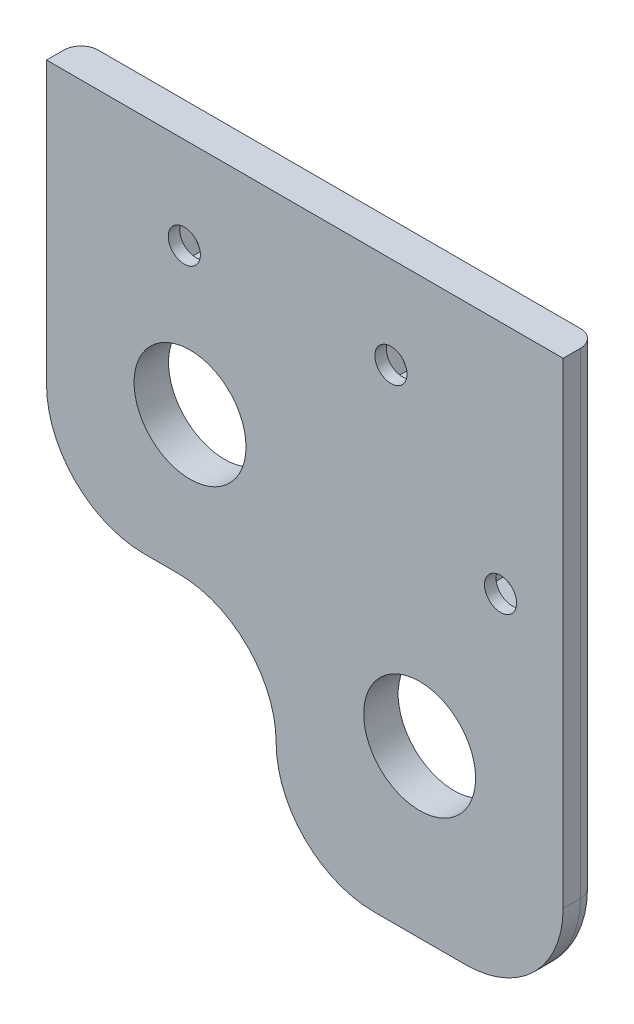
ISO-10303-21;
HEADER;
FILE_DESCRIPTION(('STEP AP214'),'2;1');
FILE_NAME('part.step','',(''),(''),'','','');
FILE_SCHEMA(('AUTOMOTIVE_DESIGN { 1 0 10303 214 1 1 1 1 }'));
ENDSEC;
DATA;
#1=APPLICATION_CONTEXT('core data for automotive mechanical design processes');
#2=APPLICATION_PROTOCOL_DEFINITION('international standard','automotive_design',2000,#1);
#3=PRODUCT_CONTEXT('',#1,'mechanical');
#4=PRODUCT('Part','Part','',(#3));
#5=PRODUCT_RELATED_PRODUCT_CATEGORY('part','',(#4));
#6=PRODUCT_DEFINITION_FORMATION('','',#4);
#7=PRODUCT_DEFINITION_CONTEXT('part definition',#1,'design');
#8=PRODUCT_DEFINITION('design','',#6,#7);
#9=PRODUCT_DEFINITION_SHAPE('','',#8);
#10=(LENGTH_UNIT() NAMED_UNIT(*) SI_UNIT(.MILLI.,.METRE.));
#11=(NAMED_UNIT(*) PLANE_ANGLE_UNIT() SI_UNIT($,.RADIAN.));
#12=(NAMED_UNIT(*) SI_UNIT($,.STERADIAN.) SOLID_ANGLE_UNIT());
#13=UNCERTAINTY_MEASURE_WITH_UNIT(LENGTH_MEASURE(1.E-05),#10,'distance_accuracy_value','');
#14=(GEOMETRIC_REPRESENTATION_CONTEXT(3) GLOBAL_UNCERTAINTY_ASSIGNED_CONTEXT((#13)) GLOBAL_UNIT_ASSIGNED_CONTEXT((#10,
#11,#12)) REPRESENTATION_CONTEXT('',''));
#15=CARTESIAN_POINT('',(0.,0.,0.));
#16=DIRECTION('',(0.,0.,1.));
#17=DIRECTION('',(1.,0.,0.));
#18=AXIS2_PLACEMENT_3D('',#15,#16,#17);
#19=CARTESIAN_POINT('',(30.,24.5,3.001));
#20=DIRECTION('',(0.,0.,-1.));
#21=DIRECTION('',(-1.,0.,0.));
#22=AXIS2_PLACEMENT_3D('',#19,#20,#21);
#23=CYLINDRICAL_SURFACE('',#22,1.4);
#24=CARTESIAN_POINT('',(30.,24.5,3.));
#25=DIRECTION('',(0.,0.,-1.));
#26=DIRECTION('',(-1.,0.,0.));
#27=AXIS2_PLACEMENT_3D('',#24,#25,#26);
#28=CIRCLE('',#27,1.4);
#29=CARTESIAN_POINT('',(28.6,24.5,3.));
#30=VERTEX_POINT('',#29);
#31=EDGE_CURVE('E394',#30,#30,#28,.F.);
#32=CARTESIAN_POINT('',(30.,24.5,2.));
#33=DIRECTION('',(0.,0.,-1.));
#34=DIRECTION('',(-1.,0.,0.));
#35=AXIS2_PLACEMENT_3D('',#32,#33,#34);
#36=CIRCLE('',#35,1.4);
#37=CARTESIAN_POINT('',(28.6,24.5,2.));
#38=VERTEX_POINT('',#37);
#39=EDGE_CURVE('E38',#38,#38,#36,.F.);
#40=CARTESIAN_POINT('',(28.6,24.5,3.));
#41=CARTESIAN_POINT('',(28.6,24.5,2.98958333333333));
#42=CARTESIAN_POINT('',(28.6,24.5,2.97916666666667));
#43=CARTESIAN_POINT('',(28.6,24.5,2.95833333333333));
#44=CARTESIAN_POINT('',(28.6,24.5,2.94791666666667));
#45=CARTESIAN_POINT('',(28.6,24.5,2.92708333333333));
#46=CARTESIAN_POINT('',(28.6,24.5,2.91666666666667));
#47=CARTESIAN_POINT('',(28.6,24.5,2.89583333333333));
#48=CARTESIAN_POINT('',(28.6,24.5,2.88541666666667));
#49=CARTESIAN_POINT('',(28.6,24.5,2.86458333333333));
#50=CARTESIAN_POINT('',(28.6,24.5,2.85416666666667));
#51=CARTESIAN_POINT('',(28.6,24.5,2.83333333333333));
#52=CARTESIAN_POINT('',(28.6,24.5,2.82291666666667));
#53=CARTESIAN_POINT('',(28.6,24.5,2.80208333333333));
#54=CARTESIAN_POINT('',(28.6,24.5,2.79166666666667));
#55=CARTESIAN_POINT('',(28.6,24.5,2.77083333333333));
#56=CARTESIAN_POINT('',(28.6,24.5,2.76041666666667));
#57=CARTESIAN_POINT('',(28.6,24.5,2.73958333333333));
#58=CARTESIAN_POINT('',(28.6,24.5,2.72916666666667));
#59=CARTESIAN_POINT('',(28.6,24.5,2.70833333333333));
#60=CARTESIAN_POINT('',(28.6,24.5,2.69791666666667));
#61=CARTESIAN_POINT('',(28.6,24.5,2.67708333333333));
#62=CARTESIAN_POINT('',(28.6,24.5,2.66666666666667));
#63=CARTESIAN_POINT('',(28.6,24.5,2.64583333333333));
#64=CARTESIAN_POINT('',(28.6,24.5,2.63541666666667));
#65=CARTESIAN_POINT('',(28.6,24.5,2.61458333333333));
#66=CARTESIAN_POINT('',(28.6,24.5,2.60416666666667));
#67=CARTESIAN_POINT('',(28.6,24.5,2.58333333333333));
#68=CARTESIAN_POINT('',(28.6,24.5,2.57291666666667));
#69=CARTESIAN_POINT('',(28.6,24.5,2.55208333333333));
#70=CARTESIAN_POINT('',(28.6,24.5,2.54166666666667));
#71=CARTESIAN_POINT('',(28.6,24.5,2.52083333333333));
#72=CARTESIAN_POINT('',(28.6,24.5,2.51041666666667));
#73=CARTESIAN_POINT('',(28.6,24.5,2.48958333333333));
#74=CARTESIAN_POINT('',(28.6,24.5,2.47916666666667));
#75=CARTESIAN_POINT('',(28.6,24.5,2.45833333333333));
#76=CARTESIAN_POINT('',(28.6,24.5,2.44791666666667));
#77=CARTESIAN_POINT('',(28.6,24.5,2.42708333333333));
#78=CARTESIAN_POINT('',(28.6,24.5,2.41666666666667));
#79=CARTESIAN_POINT('',(28.6,24.5,2.39583333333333));
#80=CARTESIAN_POINT('',(28.6,24.5,2.38541666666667));
#81=CARTESIAN_POINT('',(28.6,24.5,2.36458333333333));
#82=CARTESIAN_POINT('',(28.6,24.5,2.35416666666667));
#83=CARTESIAN_POINT('',(28.6,24.5,2.33333333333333));
#84=CARTESIAN_POINT('',(28.6,24.5,2.32291666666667));
#85=CARTESIAN_POINT('',(28.6,24.5,2.30208333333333));
#86=CARTESIAN_POINT('',(28.6,24.5,2.29166666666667));
#87=CARTESIAN_POINT('',(28.6,24.5,2.27083333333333));
#88=CARTESIAN_POINT('',(28.6,24.5,2.26041666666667));
#89=CARTESIAN_POINT('',(28.6,24.5,2.23958333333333));
#90=CARTESIAN_POINT('',(28.6,24.5,2.22916666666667));
#91=CARTESIAN_POINT('',(28.6,24.5,2.20833333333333));
#92=CARTESIAN_POINT('',(28.6,24.5,2.19791666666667));
#93=CARTESIAN_POINT('',(28.6,24.5,2.17708333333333));
#94=CARTESIAN_POINT('',(28.6,24.5,2.16666666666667));
#95=CARTESIAN_POINT('',(28.6,24.5,2.14583333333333));
#96=CARTESIAN_POINT('',(28.6,24.5,2.13541666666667));
#97=CARTESIAN_POINT('',(28.6,24.5,2.11458333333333));
#98=CARTESIAN_POINT('',(28.6,24.5,2.10416666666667));
#99=CARTESIAN_POINT('',(28.6,24.5,2.08333333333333));
#100=CARTESIAN_POINT('',(28.6,24.5,2.07291666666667));
#101=CARTESIAN_POINT('',(28.6,24.5,2.05208333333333));
#102=CARTESIAN_POINT('',(28.6,24.5,2.04166666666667));
#103=CARTESIAN_POINT('',(28.6,24.5,2.02083333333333));
#104=CARTESIAN_POINT('',(28.6,24.5,2.01041666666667));
#105=CARTESIAN_POINT('',(28.6,24.5,2.));
#106=B_SPLINE_CURVE_WITH_KNOTS('',3,(#40,#41,#42,#43,#44,#45,#46,#47,#48,#49,#50,#51,#52,#53,
#54,#55,#56,#57,#58,#59,#60,#61,#62,#63,#64,#65,#66,#67,#68,#69,#70,#71,#72,#73,#74,#75,#76,#77,
#78,#79,#80,#81,#82,#83,#84,#85,#86,#87,#88,#89,#90,#91,#92,#93,#94,#95,#96,#97,#98,#99,#100,
#101,#102,#103,#104,#105),.UNSPECIFIED.,.F.,.F.,(4,2,2,2,2,2,2,2,2,2,2,2,2,2,2,2,2,2,2,2,2,2,2,
2,2,2,2,2,2,2,2,2,4),(0.,0.03125,0.0625000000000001,0.0937500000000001,0.125,0.15625,0.1875,
0.21875,0.25,0.28125,0.3125,0.34375,0.375,0.40625,0.4375,0.46875,0.5,0.53125,0.5625,0.59375,
0.625,0.65625,0.6875,0.71875,0.75,0.78125,0.8125,0.84375,0.875,0.90625,0.9375,0.96875,1.),.UNSPECIFIED.);
#107=EDGE_CURVE('BSEAM34',#30,#38,#106,.T.);
#108=ORIENTED_EDGE('',*,*,#31,.T.);
#109=ORIENTED_EDGE('',*,*,#39,.F.);
#110=ORIENTED_EDGE('',*,*,#107,.T.);
#111=ORIENTED_EDGE('',*,*,#107,.F.);
#112=EDGE_LOOP('',(#108,#110,#109,#111));
#113=FACE_BOUND('',#112,.T.);
#114=ADVANCED_FACE('F34',(#113),#23,.F.);
#115=CARTESIAN_POINT('',(12.,24.5,3.001));
#116=DIRECTION('',(0.,0.,-1.));
#117=DIRECTION('',(-1.,0.,0.));
#118=AXIS2_PLACEMENT_3D('',#115,#116,#117);
#119=CYLINDRICAL_SURFACE('',#118,1.4);
#120=CARTESIAN_POINT('',(12.,24.5,3.));
#121=DIRECTION('',(0.,0.,-1.));
#122=DIRECTION('',(-1.,0.,0.));
#123=AXIS2_PLACEMENT_3D('',#120,#121,#122);
#124=CIRCLE('',#123,1.4);
#125=CARTESIAN_POINT('',(10.6,24.5,3.));
#126=VERTEX_POINT('',#125);
#127=EDGE_CURVE('E391',#126,#126,#124,.F.);
#128=CARTESIAN_POINT('',(12.,24.5,2.));
#129=DIRECTION('',(0.,0.,-1.));
#130=DIRECTION('',(-1.,0.,0.));
#131=AXIS2_PLACEMENT_3D('',#128,#129,#130);
#132=CIRCLE('',#131,1.4);
#133=CARTESIAN_POINT('',(10.6,24.5,2.));
#134=VERTEX_POINT('',#133);
#135=EDGE_CURVE('E516',#134,#134,#132,.F.);
#136=CARTESIAN_POINT('',(10.6,24.5,3.));
#137=CARTESIAN_POINT('',(10.6,24.5,2.98958333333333));
#138=CARTESIAN_POINT('',(10.6,24.5,2.97916666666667));
#139=CARTESIAN_POINT('',(10.6,24.5,2.95833333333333));
#140=CARTESIAN_POINT('',(10.6,24.5,2.94791666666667));
#141=CARTESIAN_POINT('',(10.6,24.5,2.92708333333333));
#142=CARTESIAN_POINT('',(10.6,24.5,2.91666666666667));
#143=CARTESIAN_POINT('',(10.6,24.5,2.89583333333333));
#144=CARTESIAN_POINT('',(10.6,24.5,2.88541666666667));
#145=CARTESIAN_POINT('',(10.6,24.5,2.86458333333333));
#146=CARTESIAN_POINT('',(10.6,24.5,2.85416666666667));
#147=CARTESIAN_POINT('',(10.6,24.5,2.83333333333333));
#148=CARTESIAN_POINT('',(10.6,24.5,2.82291666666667));
#149=CARTESIAN_POINT('',(10.6,24.5,2.80208333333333));
#150=CARTESIAN_POINT('',(10.6,24.5,2.79166666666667));
#151=CARTESIAN_POINT('',(10.6,24.5,2.77083333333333));
#152=CARTESIAN_POINT('',(10.6,24.5,2.76041666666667));
#153=CARTESIAN_POINT('',(10.6,24.5,2.73958333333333));
#154=CARTESIAN_POINT('',(10.6,24.5,2.72916666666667));
#155=CARTESIAN_POINT('',(10.6,24.5,2.70833333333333));
#156=CARTESIAN_POINT('',(10.6,24.5,2.69791666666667));
#157=CARTESIAN_POINT('',(10.6,24.5,2.67708333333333));
#158=CARTESIAN_POINT('',(10.6,24.5,2.66666666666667));
#159=CARTESIAN_POINT('',(10.6,24.5,2.64583333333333));
#160=CARTESIAN_POINT('',(10.6,24.5,2.63541666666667));
#161=CARTESIAN_POINT('',(10.6,24.5,2.61458333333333));
#162=CARTESIAN_POINT('',(10.6,24.5,2.60416666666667));
#163=CARTESIAN_POINT('',(10.6,24.5,2.58333333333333));
#164=CARTESIAN_POINT('',(10.6,24.5,2.57291666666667));
#165=CARTESIAN_POINT('',(10.6,24.5,2.55208333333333));
#166=CARTESIAN_POINT('',(10.6,24.5,2.54166666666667));
#167=CARTESIAN_POINT('',(10.6,24.5,2.52083333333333));
#168=CARTESIAN_POINT('',(10.6,24.5,2.51041666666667));
#169=CARTESIAN_POINT('',(10.6,24.5,2.48958333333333));
#170=CARTESIAN_POINT('',(10.6,24.5,2.47916666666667));
#171=CARTESIAN_POINT('',(10.6,24.5,2.45833333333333));
#172=CARTESIAN_POINT('',(10.6,24.5,2.44791666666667));
#173=CARTESIAN_POINT('',(10.6,24.5,2.42708333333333));
#174=CARTESIAN_POINT('',(10.6,24.5,2.41666666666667));
#175=CARTESIAN_POINT('',(10.6,24.5,2.39583333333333));
#176=CARTESIAN_POINT('',(10.6,24.5,2.38541666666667));
#177=CARTESIAN_POINT('',(10.6,24.5,2.36458333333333));
#178=CARTESIAN_POINT('',(10.6,24.5,2.35416666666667));
#179=CARTESIAN_POINT('',(10.6,24.5,2.33333333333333));
#180=CARTESIAN_POINT('',(10.6,24.5,2.32291666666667));
#181=CARTESIAN_POINT('',(10.6,24.5,2.30208333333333));
#182=CARTESIAN_POINT('',(10.6,24.5,2.29166666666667));
#183=CARTESIAN_POINT('',(10.6,24.5,2.27083333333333));
#184=CARTESIAN_POINT('',(10.6,24.5,2.26041666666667));
#185=CARTESIAN_POINT('',(10.6,24.5,2.23958333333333));
#186=CARTESIAN_POINT('',(10.6,24.5,2.22916666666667));
#187=CARTESIAN_POINT('',(10.6,24.5,2.20833333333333));
#188=CARTESIAN_POINT('',(10.6,24.5,2.19791666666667));
#189=CARTESIAN_POINT('',(10.6,24.5,2.17708333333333));
#190=CARTESIAN_POINT('',(10.6,24.5,2.16666666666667));
#191=CARTESIAN_POINT('',(10.6,24.5,2.14583333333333));
#192=CARTESIAN_POINT('',(10.6,24.5,2.13541666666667));
#193=CARTESIAN_POINT('',(10.6,24.5,2.11458333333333));
#194=CARTESIAN_POINT('',(10.6,24.5,2.10416666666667));
#195=CARTESIAN_POINT('',(10.6,24.5,2.08333333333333));
#196=CARTESIAN_POINT('',(10.6,24.5,2.07291666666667));
#197=CARTESIAN_POINT('',(10.6,24.5,2.05208333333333));
#198=CARTESIAN_POINT('',(10.6,24.5,2.04166666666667));
#199=CARTESIAN_POINT('',(10.6,24.5,2.02083333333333));
#200=CARTESIAN_POINT('',(10.6,24.5,2.01041666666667));
#201=CARTESIAN_POINT('',(10.6,24.5,2.));
#202=B_SPLINE_CURVE_WITH_KNOTS('',3,(#136,#137,#138,#139,#140,#141,#142,#143,#144,#145,#146,
#147,#148,#149,#150,#151,#152,#153,#154,#155,#156,#157,#158,#159,#160,#161,#162,#163,#164,#165,
#166,#167,#168,#169,#170,#171,#172,#173,#174,#175,#176,#177,#178,#179,#180,#181,#182,#183,#184,
#185,#186,#187,#188,#189,#190,#191,#192,#193,#194,#195,#196,#197,#198,#199,#200,#201),
.UNSPECIFIED.,.F.,.F.,(4,2,2,2,2,2,2,2,2,2,2,2,2,2,2,2,2,2,2,2,2,2,2,2,2,2,2,2,2,2,2,2,4),(0.,
0.03125,0.0625000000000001,0.0937500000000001,0.125,0.15625,0.1875,0.21875,0.25,0.28125,0.3125,
0.34375,0.375,0.40625,0.4375,0.46875,0.5,0.53125,0.5625,0.59375,0.625,0.65625,0.6875,0.71875,
0.75,0.78125,0.8125,0.84375,0.875,0.90625,0.9375,0.96875,1.),.UNSPECIFIED.);
#203=EDGE_CURVE('BSEAM526',#126,#134,#202,.T.);
#204=ORIENTED_EDGE('',*,*,#127,.T.);
#205=ORIENTED_EDGE('',*,*,#135,.F.);
#206=ORIENTED_EDGE('',*,*,#203,.T.);
#207=ORIENTED_EDGE('',*,*,#203,.F.);
#208=EDGE_LOOP('',(#204,#206,#205,#207));
#209=FACE_BOUND('',#208,.T.);
#210=ADVANCED_FACE('F526',(#209),#119,.F.);
#211=CARTESIAN_POINT('',(39.55,12.,3.001));
#212=DIRECTION('',(0.,0.,-1.));
#213=DIRECTION('',(-1.,0.,0.));
#214=AXIS2_PLACEMENT_3D('',#211,#212,#213);
#215=CYLINDRICAL_SURFACE('',#214,1.4);
#216=CARTESIAN_POINT('',(39.55,12.,3.));
#217=DIRECTION('',(0.,0.,-1.));
#218=DIRECTION('',(-1.,0.,0.));
#219=AXIS2_PLACEMENT_3D('',#216,#217,#218);
#220=CIRCLE('',#219,1.4);
#221=CARTESIAN_POINT('',(38.15,12.,3.));
#222=VERTEX_POINT('',#221);
#223=EDGE_CURVE('E395',#222,#222,#220,.F.);
#224=CARTESIAN_POINT('',(39.55,12.,2.));
#225=DIRECTION('',(0.,0.,-1.));
#226=DIRECTION('',(-1.,0.,0.));
#227=AXIS2_PLACEMENT_3D('',#224,#225,#226);
#228=CIRCLE('',#227,1.4);
#229=CARTESIAN_POINT('',(38.15,12.,2.));
#230=VERTEX_POINT('',#229);
#231=EDGE_CURVE('E290',#230,#230,#228,.F.);
#232=CARTESIAN_POINT('',(38.15,12.,3.));
#233=CARTESIAN_POINT('',(38.15,12.,2.98958333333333));
#234=CARTESIAN_POINT('',(38.15,12.,2.97916666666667));
#235=CARTESIAN_POINT('',(38.15,12.,2.95833333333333));
#236=CARTESIAN_POINT('',(38.15,12.,2.94791666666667));
#237=CARTESIAN_POINT('',(38.15,12.,2.92708333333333));
#238=CARTESIAN_POINT('',(38.15,12.,2.91666666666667));
#239=CARTESIAN_POINT('',(38.15,12.,2.89583333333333));
#240=CARTESIAN_POINT('',(38.15,12.,2.88541666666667));
#241=CARTESIAN_POINT('',(38.15,12.,2.86458333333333));
#242=CARTESIAN_POINT('',(38.15,12.,2.85416666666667));
#243=CARTESIAN_POINT('',(38.15,12.,2.83333333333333));
#244=CARTESIAN_POINT('',(38.15,12.,2.82291666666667));
#245=CARTESIAN_POINT('',(38.15,12.,2.80208333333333));
#246=CARTESIAN_POINT('',(38.15,12.,2.79166666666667));
#247=CARTESIAN_POINT('',(38.15,12.,2.77083333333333));
#248=CARTESIAN_POINT('',(38.15,12.,2.76041666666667));
#249=CARTESIAN_POINT('',(38.15,12.,2.73958333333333));
#250=CARTESIAN_POINT('',(38.15,12.,2.72916666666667));
#251=CARTESIAN_POINT('',(38.15,12.,2.70833333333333));
#252=CARTESIAN_POINT('',(38.15,12.,2.69791666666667));
#253=CARTESIAN_POINT('',(38.15,12.,2.67708333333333));
#254=CARTESIAN_POINT('',(38.15,12.,2.66666666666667));
#255=CARTESIAN_POINT('',(38.15,12.,2.64583333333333));
#256=CARTESIAN_POINT('',(38.15,12.,2.63541666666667));
#257=CARTESIAN_POINT('',(38.15,12.,2.61458333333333));
#258=CARTESIAN_POINT('',(38.15,12.,2.60416666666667));
#259=CARTESIAN_POINT('',(38.15,12.,2.58333333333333));
#260=CARTESIAN_POINT('',(38.15,12.,2.57291666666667));
#261=CARTESIAN_POINT('',(38.15,12.,2.55208333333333));
#262=CARTESIAN_POINT('',(38.15,12.,2.54166666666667));
#263=CARTESIAN_POINT('',(38.15,12.,2.52083333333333));
#264=CARTESIAN_POINT('',(38.15,12.,2.51041666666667));
#265=CARTESIAN_POINT('',(38.15,12.,2.48958333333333));
#266=CARTESIAN_POINT('',(38.15,12.,2.47916666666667));
#267=CARTESIAN_POINT('',(38.15,12.,2.45833333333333));
#268=CARTESIAN_POINT('',(38.15,12.,2.44791666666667));
#269=CARTESIAN_POINT('',(38.15,12.,2.42708333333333));
#270=CARTESIAN_POINT('',(38.15,12.,2.41666666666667));
#271=CARTESIAN_POINT('',(38.15,12.,2.39583333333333));
#272=CARTESIAN_POINT('',(38.15,12.,2.38541666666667));
#273=CARTESIAN_POINT('',(38.15,12.,2.36458333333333));
#274=CARTESIAN_POINT('',(38.15,12.,2.35416666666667));
#275=CARTESIAN_POINT('',(38.15,12.,2.33333333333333));
#276=CARTESIAN_POINT('',(38.15,12.,2.32291666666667));
#277=CARTESIAN_POINT('',(38.15,12.,2.30208333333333));
#278=CARTESIAN_POINT('',(38.15,12.,2.29166666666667));
#279=CARTESIAN_POINT('',(38.15,12.,2.27083333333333));
#280=CARTESIAN_POINT('',(38.15,12.,2.26041666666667));
#281=CARTESIAN_POINT('',(38.15,12.,2.23958333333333));
#282=CARTESIAN_POINT('',(38.15,12.,2.22916666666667));
#283=CARTESIAN_POINT('',(38.15,12.,2.20833333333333));
#284=CARTESIAN_POINT('',(38.15,12.,2.19791666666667));
#285=CARTESIAN_POINT('',(38.15,12.,2.17708333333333));
#286=CARTESIAN_POINT('',(38.15,12.,2.16666666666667));
#287=CARTESIAN_POINT('',(38.15,12.,2.14583333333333));
#288=CARTESIAN_POINT('',(38.15,12.,2.13541666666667));
#289=CARTESIAN_POINT('',(38.15,12.,2.11458333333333));
#290=CARTESIAN_POINT('',(38.15,12.,2.10416666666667));
#291=CARTESIAN_POINT('',(38.15,12.,2.08333333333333));
#292=CARTESIAN_POINT('',(38.15,12.,2.07291666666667));
#293=CARTESIAN_POINT('',(38.15,12.,2.05208333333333));
#294=CARTESIAN_POINT('',(38.15,12.,2.04166666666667));
#295=CARTESIAN_POINT('',(38.15,12.,2.02083333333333));
#296=CARTESIAN_POINT('',(38.15,12.,2.01041666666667));
#297=CARTESIAN_POINT('',(38.15,12.,2.));
#298=B_SPLINE_CURVE_WITH_KNOTS('',3,(#232,#233,#234,#235,#236,#237,#238,#239,#240,#241,#242,
#243,#244,#245,#246,#247,#248,#249,#250,#251,#252,#253,#254,#255,#256,#257,#258,#259,#260,#261,
#262,#263,#264,#265,#266,#267,#268,#269,#270,#271,#272,#273,#274,#275,#276,#277,#278,#279,#280,
#281,#282,#283,#284,#285,#286,#287,#288,#289,#290,#291,#292,#293,#294,#295,#296,#297),
.UNSPECIFIED.,.F.,.F.,(4,2,2,2,2,2,2,2,2,2,2,2,2,2,2,2,2,2,2,2,2,2,2,2,2,2,2,2,2,2,2,2,4),(0.,
0.03125,0.0625000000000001,0.0937500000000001,0.125,0.15625,0.1875,0.21875,0.25,0.28125,0.3125,
0.34375,0.375,0.40625,0.4375,0.46875,0.5,0.53125,0.5625,0.59375,0.625,0.65625,0.6875,0.71875,
0.75,0.78125,0.8125,0.84375,0.875,0.90625,0.9375,0.96875,1.),.UNSPECIFIED.);
#299=EDGE_CURVE('BSEAM532',#222,#230,#298,.T.);
#300=ORIENTED_EDGE('',*,*,#223,.T.);
#301=ORIENTED_EDGE('',*,*,#231,.F.);
#302=ORIENTED_EDGE('',*,*,#299,.T.);
#303=ORIENTED_EDGE('',*,*,#299,.F.);
#304=EDGE_LOOP('',(#300,#302,#301,#303));
#305=FACE_BOUND('',#304,.T.);
#306=ADVANCED_FACE('F532',(#305),#215,.F.);
#307=CARTESIAN_POINT('',(0.,0.,3.));
#308=DIRECTION('',(0.,0.,-1.));
#309=DIRECTION('',(-1.,0.,0.));
#310=AXIS2_PLACEMENT_3D('',#307,#308,#309);
#311=PLANE('',#310);
#312=ORIENTED_EDGE('',*,*,#223,.F.);
#313=EDGE_LOOP('',(#312));
#314=FACE_BOUND('',#313,.T.);
#315=ORIENTED_EDGE('',*,*,#127,.F.);
#316=EDGE_LOOP('',(#315));
#317=FACE_BOUND('',#316,.T.);
#318=ORIENTED_EDGE('',*,*,#31,.F.);
#319=EDGE_LOOP('',(#318));
#320=FACE_BOUND('',#319,.T.);
#321=DIRECTION('',(1.,0.,0.));
#322=VECTOR('',#321,1.);
#323=CARTESIAN_POINT('',(45.,-17.5,3.));
#324=LINE('',#323,#322);
#325=CARTESIAN_POINT('',(28.5,-17.5,3.));
#326=VERTEX_POINT('',#325);
#327=CARTESIAN_POINT('',(36.5,-17.5,3.));
#328=VERTEX_POINT('',#327);
#329=EDGE_CURVE('E425',#326,#328,#324,.T.);
#330=ORIENTED_EDGE('',*,*,#329,.T.);
#331=CARTESIAN_POINT('',(36.5,-9.00000000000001,3.));
#332=DIRECTION('',(0.,0.,-1.));
#333=DIRECTION('',(-1.,0.,0.));
#334=AXIS2_PLACEMENT_3D('',#331,#332,#333);
#335=CIRCLE('',#334,8.5);
#336=CARTESIAN_POINT('',(45.,-9.00000000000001,3.));
#337=VERTEX_POINT('',#336);
#338=EDGE_CURVE('E453',#328,#337,#335,.F.);
#339=ORIENTED_EDGE('',*,*,#338,.T.);
#340=DIRECTION('',(0.,1.,0.));
#341=VECTOR('',#340,1.);
#342=CARTESIAN_POINT('',(45.,32.5,3.));
#343=LINE('',#342,#341);
#344=CARTESIAN_POINT('',(45.,32.5,3.));
#345=VERTEX_POINT('',#344);
#346=EDGE_CURVE('E418',#337,#345,#343,.T.);
#347=ORIENTED_EDGE('',*,*,#346,.T.);
#348=DIRECTION('',(-1.,0.,0.));
#349=VECTOR('',#348,1.);
#350=CARTESIAN_POINT('',(0.,32.5,3.));
#351=LINE('',#350,#349);
#352=CARTESIAN_POINT('',(0.,32.5,3.));
#353=VERTEX_POINT('',#352);
#354=EDGE_CURVE('E420',#345,#353,#351,.T.);
#355=ORIENTED_EDGE('',*,*,#354,.T.);
#356=DIRECTION('',(0.,-1.,0.));
#357=VECTOR('',#356,1.);
#358=CARTESIAN_POINT('',(0.,32.5,3.));
#359=LINE('',#358,#357);
#360=CARTESIAN_POINT('',(0.,7.99999999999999,3.));
#361=VERTEX_POINT('',#360);
#362=EDGE_CURVE('E422',#353,#361,#359,.T.);
#363=ORIENTED_EDGE('',*,*,#362,.T.);
#364=CARTESIAN_POINT('',(8.5,7.99999999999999,3.));
#365=DIRECTION('',(0.,0.,-1.));
#366=DIRECTION('',(-1.,0.,0.));
#367=AXIS2_PLACEMENT_3D('',#364,#365,#366);
#368=CIRCLE('',#367,8.5);
#369=CARTESIAN_POINT('',(8.5,-0.500000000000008,3.));
#370=VERTEX_POINT('',#369);
#371=EDGE_CURVE('E451',#361,#370,#368,.F.);
#372=ORIENTED_EDGE('',*,*,#371,.T.);
#373=DIRECTION('',(-1.,0.,0.));
#374=VECTOR('',#373,1.);
#375=CARTESIAN_POINT('',(0.,-0.500000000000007,3.));
#376=LINE('',#375,#374);
#377=CARTESIAN_POINT('',(11.5,-0.500000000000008,3.));
#378=VERTEX_POINT('',#377);
#379=EDGE_CURVE('E401',#378,#370,#376,.T.);
#380=ORIENTED_EDGE('',*,*,#379,.F.);
#381=CARTESIAN_POINT('',(11.5,-9.00000000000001,3.));
#382=DIRECTION('',(0.,0.,-1.));
#383=DIRECTION('',(-1.,0.,0.));
#384=AXIS2_PLACEMENT_3D('',#381,#382,#383);
#385=CIRCLE('',#384,8.5);
#386=CARTESIAN_POINT('',(20.,-9.00000000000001,3.));
#387=VERTEX_POINT('',#386);
#388=EDGE_CURVE('E457',#378,#387,#385,.T.);
#389=ORIENTED_EDGE('',*,*,#388,.T.);
#390=CARTESIAN_POINT('',(28.5,-9.00000000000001,3.));
#391=DIRECTION('',(0.,0.,-1.));
#392=DIRECTION('',(-1.,0.,0.));
#393=AXIS2_PLACEMENT_3D('',#390,#391,#392);
#394=CIRCLE('',#393,8.5);
#395=EDGE_CURVE('E449',#387,#326,#394,.F.);
#396=ORIENTED_EDGE('',*,*,#395,.T.);
#397=EDGE_LOOP('',(#330,#339,#347,#355,#363,#372,#380,#389,#396));
#398=FACE_BOUND('',#397,.T.);
#399=CARTESIAN_POINT('',(32.5,-3.00000000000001,3.));
#400=DIRECTION('',(0.,0.,1.));
#401=DIRECTION('',(1.,0.,0.));
#402=AXIS2_PLACEMENT_3D('',#399,#400,#401);
#403=CIRCLE('',#402,4.875);
#404=CARTESIAN_POINT('',(37.375,-3.00000000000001,3.));
#405=VERTEX_POINT('',#404);
#406=EDGE_CURVE('E412',#405,#405,#403,.T.);
#407=ORIENTED_EDGE('',*,*,#406,.F.);
#408=EDGE_LOOP('',(#407));
#409=FACE_BOUND('',#408,.T.);
#410=CARTESIAN_POINT('',(12.5,12.,3.));
#411=DIRECTION('',(0.,0.,1.));
#412=DIRECTION('',(1.,0.,0.));
#413=AXIS2_PLACEMENT_3D('',#410,#411,#412);
#414=CIRCLE('',#413,4.875);
#415=CARTESIAN_POINT('',(17.375,12.,3.));
#416=VERTEX_POINT('',#415);
#417=EDGE_CURVE('E406',#416,#416,#414,.T.);
#418=ORIENTED_EDGE('',*,*,#417,.F.);
#419=EDGE_LOOP('',(#418));
#420=FACE_BOUND('',#419,.T.);
#421=ADVANCED_FACE('F551',(#314,#317,#320,#398,#409,#420),#311,.F.);
#422=CARTESIAN_POINT('',(0.,0.,0.));
#423=DIRECTION('',(0.,0.,-1.));
#424=DIRECTION('',(-1.,0.,0.));
#425=AXIS2_PLACEMENT_3D('',#422,#423,#424);
#426=PLANE('',#425);
#427=DIRECTION('',(0.,1.,0.));
#428=VECTOR('',#427,1.);
#429=CARTESIAN_POINT('',(36.825,10.4267205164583,0.));
#430=LINE('',#429,#428);
#431=CARTESIAN_POINT('',(36.825,10.4267205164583,0.));
#432=VERTEX_POINT('',#431);
#433=CARTESIAN_POINT('',(36.825,13.5732794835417,0.));
#434=VERTEX_POINT('',#433);
#435=EDGE_CURVE('E51',#432,#434,#430,.T.);
#436=ORIENTED_EDGE('',*,*,#435,.F.);
#437=DIRECTION('',(-0.866025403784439,0.499999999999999,0.));
#438=VECTOR('',#437,1.);
#439=CARTESIAN_POINT('',(39.55,8.85344103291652,0.));
#440=LINE('',#439,#438);
#441=CARTESIAN_POINT('',(39.55,8.85344103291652,0.));
#442=VERTEX_POINT('',#441);
#443=EDGE_CURVE('E263',#442,#432,#440,.T.);
#444=ORIENTED_EDGE('',*,*,#443,.F.);
#445=DIRECTION('',(-0.866025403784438,-0.500000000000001,0.));
#446=VECTOR('',#445,1.);
#447=CARTESIAN_POINT('',(42.275,10.4267205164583,0.));
#448=LINE('',#447,#446);
#449=CARTESIAN_POINT('',(42.275,10.4267205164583,0.));
#450=VERTEX_POINT('',#449);
#451=EDGE_CURVE('E266',#450,#442,#448,.T.);
#452=ORIENTED_EDGE('',*,*,#451,.F.);
#453=DIRECTION('',(0.,-1.,0.));
#454=VECTOR('',#453,1.);
#455=CARTESIAN_POINT('',(42.275,13.5732794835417,0.));
#456=LINE('',#455,#454);
#457=CARTESIAN_POINT('',(42.275,13.5732794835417,0.));
#458=VERTEX_POINT('',#457);
#459=EDGE_CURVE('E283',#458,#450,#456,.T.);
#460=ORIENTED_EDGE('',*,*,#459,.F.);
#461=DIRECTION('',(0.866025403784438,-0.5,0.));
#462=VECTOR('',#461,1.);
#463=CARTESIAN_POINT('',(39.55,15.1465589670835,0.));
#464=LINE('',#463,#462);
#465=CARTESIAN_POINT('',(39.55,15.1465589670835,0.));
#466=VERTEX_POINT('',#465);
#467=EDGE_CURVE('E280',#466,#458,#464,.T.);
#468=ORIENTED_EDGE('',*,*,#467,.F.);
#469=DIRECTION('',(0.866025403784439,0.499999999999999,0.));
#470=VECTOR('',#469,1.);
#471=CARTESIAN_POINT('',(36.825,13.5732794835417,0.));
#472=LINE('',#471,#470);
#473=EDGE_CURVE('E277',#434,#466,#472,.T.);
#474=ORIENTED_EDGE('',*,*,#473,.F.);
#475=EDGE_LOOP('',(#436,#444,#452,#460,#468,#474));
#476=FACE_BOUND('',#475,.T.);
#477=DIRECTION('',(-0.5,0.866025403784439,0.));
#478=VECTOR('',#477,1.);
#479=CARTESIAN_POINT('',(28.4267205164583,21.775,0.));
#480=LINE('',#479,#478);
#481=CARTESIAN_POINT('',(28.4267205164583,21.775,0.));
#482=VERTEX_POINT('',#481);
#483=CARTESIAN_POINT('',(26.8534410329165,24.5,0.));
#484=VERTEX_POINT('',#483);
#485=EDGE_CURVE('E59',#482,#484,#480,.T.);
#486=ORIENTED_EDGE('',*,*,#485,.F.);
#487=DIRECTION('',(-1.,0.,0.));
#488=VECTOR('',#487,1.);
#489=CARTESIAN_POINT('',(31.5732794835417,21.775,0.));
#490=LINE('',#489,#488);
#491=CARTESIAN_POINT('',(31.5732794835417,21.775,0.));
#492=VERTEX_POINT('',#491);
#493=EDGE_CURVE('E302',#492,#482,#490,.T.);
#494=ORIENTED_EDGE('',*,*,#493,.F.);
#495=DIRECTION('',(-0.499999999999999,-0.866025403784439,0.));
#496=VECTOR('',#495,1.);
#497=CARTESIAN_POINT('',(33.1465589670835,24.5,0.));
#498=LINE('',#497,#496);
#499=CARTESIAN_POINT('',(33.1465589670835,24.5,0.));
#500=VERTEX_POINT('',#499);
#501=EDGE_CURVE('E329',#500,#492,#498,.T.);
#502=ORIENTED_EDGE('',*,*,#501,.F.);
#503=DIRECTION('',(0.5,-0.866025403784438,0.));
#504=VECTOR('',#503,1.);
#505=CARTESIAN_POINT('',(31.5732794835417,27.225,0.));
#506=LINE('',#505,#504);
#507=CARTESIAN_POINT('',(31.5732794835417,27.225,0.));
#508=VERTEX_POINT('',#507);
#509=EDGE_CURVE('E326',#508,#500,#506,.T.);
#510=ORIENTED_EDGE('',*,*,#509,.F.);
#511=DIRECTION('',(1.,0.,0.));
#512=VECTOR('',#511,1.);
#513=CARTESIAN_POINT('',(28.4267205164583,27.225,0.));
#514=LINE('',#513,#512);
#515=CARTESIAN_POINT('',(28.4267205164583,27.225,0.));
#516=VERTEX_POINT('',#515);
#517=EDGE_CURVE('E323',#516,#508,#514,.T.);
#518=ORIENTED_EDGE('',*,*,#517,.F.);
#519=DIRECTION('',(0.5,0.866025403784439,0.));
#520=VECTOR('',#519,1.);
#521=CARTESIAN_POINT('',(26.8534410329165,24.5,0.));
#522=LINE('',#521,#520);
#523=EDGE_CURVE('E319',#484,#516,#522,.T.);
#524=ORIENTED_EDGE('',*,*,#523,.F.);
#525=EDGE_LOOP('',(#486,#494,#502,#510,#518,#524));
#526=FACE_BOUND('',#525,.T.);
#527=DIRECTION('',(-0.499999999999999,0.866025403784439,0.));
#528=VECTOR('',#527,1.);
#529=CARTESIAN_POINT('',(10.4267205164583,21.775,0.));
#530=LINE('',#529,#528);
#531=CARTESIAN_POINT('',(10.4267205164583,21.775,0.));
#532=VERTEX_POINT('',#531);
#533=CARTESIAN_POINT('',(8.85344103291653,24.5,0.));
#534=VERTEX_POINT('',#533);
#535=EDGE_CURVE('E364',#532,#534,#530,.T.);
#536=ORIENTED_EDGE('',*,*,#535,.F.);
#537=DIRECTION('',(-1.,0.,0.));
#538=VECTOR('',#537,1.);
#539=CARTESIAN_POINT('',(13.5732794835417,21.775,0.));
#540=LINE('',#539,#538);
#541=CARTESIAN_POINT('',(13.5732794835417,21.775,0.));
#542=VERTEX_POINT('',#541);
#543=EDGE_CURVE('E348',#542,#532,#540,.T.);
#544=ORIENTED_EDGE('',*,*,#543,.F.);
#545=DIRECTION('',(-0.5,-0.866025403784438,0.));
#546=VECTOR('',#545,1.);
#547=CARTESIAN_POINT('',(15.1465589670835,24.5,0.));
#548=LINE('',#547,#546);
#549=CARTESIAN_POINT('',(15.1465589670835,24.5,0.));
#550=VERTEX_POINT('',#549);
#551=EDGE_CURVE('E375',#550,#542,#548,.T.);
#552=ORIENTED_EDGE('',*,*,#551,.F.);
#553=DIRECTION('',(0.5,-0.866025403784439,0.));
#554=VECTOR('',#553,1.);
#555=CARTESIAN_POINT('',(13.5732794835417,27.225,0.));
#556=LINE('',#555,#554);
#557=CARTESIAN_POINT('',(13.5732794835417,27.225,0.));
#558=VERTEX_POINT('',#557);
#559=EDGE_CURVE('E372',#558,#550,#556,.T.);
#560=ORIENTED_EDGE('',*,*,#559,.F.);
#561=DIRECTION('',(1.,0.,0.));
#562=VECTOR('',#561,1.);
#563=CARTESIAN_POINT('',(10.4267205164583,27.225,0.));
#564=LINE('',#563,#562);
#565=CARTESIAN_POINT('',(10.4267205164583,27.225,0.));
#566=VERTEX_POINT('',#565);
#567=EDGE_CURVE('E369',#566,#558,#564,.T.);
#568=ORIENTED_EDGE('',*,*,#567,.F.);
#569=DIRECTION('',(0.5,0.866025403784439,0.));
#570=VECTOR('',#569,1.);
#571=CARTESIAN_POINT('',(8.85344103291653,24.5,0.));
#572=LINE('',#571,#570);
#573=EDGE_CURVE('E366',#534,#566,#572,.T.);
#574=ORIENTED_EDGE('',*,*,#573,.F.);
#575=EDGE_LOOP('',(#536,#544,#552,#560,#568,#574));
#576=FACE_BOUND('',#575,.T.);
#577=DIRECTION('',(-1.,0.,0.));
#578=VECTOR('',#577,1.);
#579=CARTESIAN_POINT('',(0.,32.5,0.));
#580=LINE('',#579,#578);
#581=CARTESIAN_POINT('',(43.5,32.5,0.));
#582=VERTEX_POINT('',#581);
#583=CARTESIAN_POINT('',(1.5,32.5,0.));
#584=VERTEX_POINT('',#583);
#585=EDGE_CURVE('E415',#582,#584,#580,.T.);
#586=ORIENTED_EDGE('',*,*,#585,.F.);
#587=DIRECTION('',(0.,1.,0.));
#588=VECTOR('',#587,1.);
#589=CARTESIAN_POINT('',(43.5,-9.00000000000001,0.));
#590=LINE('',#589,#588);
#591=CARTESIAN_POINT('',(43.5,-9.00000000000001,0.));
#592=VERTEX_POINT('',#591);
#593=EDGE_CURVE('E483',#582,#592,#590,.F.);
#594=ORIENTED_EDGE('',*,*,#593,.T.);
#595=CARTESIAN_POINT('',(36.5,-9.00000000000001,0.));
#596=DIRECTION('',(0.,0.,-1.));
#597=DIRECTION('',(-1.,0.,0.));
#598=AXIS2_PLACEMENT_3D('',#595,#596,#597);
#599=CIRCLE('',#598,7.);
#600=CARTESIAN_POINT('',(36.5,-16.,0.));
#601=VERTEX_POINT('',#600);
#602=EDGE_CURVE('E481',#592,#601,#599,.T.);
#603=ORIENTED_EDGE('',*,*,#602,.T.);
#604=DIRECTION('',(1.,0.,0.));
#605=VECTOR('',#604,1.);
#606=CARTESIAN_POINT('',(28.5,-16.,0.));
#607=LINE('',#606,#605);
#608=CARTESIAN_POINT('',(28.5,-16.,0.));
#609=VERTEX_POINT('',#608);
#610=EDGE_CURVE('E479',#601,#609,#607,.F.);
#611=ORIENTED_EDGE('',*,*,#610,.T.);
#612=CARTESIAN_POINT('',(28.5,-9.00000000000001,0.));
#613=DIRECTION('',(0.,0.,-1.));
#614=DIRECTION('',(-1.,0.,0.));
#615=AXIS2_PLACEMENT_3D('',#612,#613,#614);
#616=CIRCLE('',#615,7.);
#617=CARTESIAN_POINT('',(21.5,-9.00000000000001,0.));
#618=VERTEX_POINT('',#617);
#619=EDGE_CURVE('E477',#609,#618,#616,.T.);
#620=ORIENTED_EDGE('',*,*,#619,.T.);
#621=CARTESIAN_POINT('',(11.5,-9.00000000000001,0.));
#622=DIRECTION('',(0.,0.,-1.));
#623=DIRECTION('',(-1.,0.,0.));
#624=AXIS2_PLACEMENT_3D('',#621,#622,#623);
#625=CIRCLE('',#624,10.);
#626=CARTESIAN_POINT('',(11.5,0.999999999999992,0.));
#627=VERTEX_POINT('',#626);
#628=EDGE_CURVE('E469',#618,#627,#625,.F.);
#629=ORIENTED_EDGE('',*,*,#628,.T.);
#630=DIRECTION('',(-1.,0.,0.));
#631=VECTOR('',#630,1.);
#632=CARTESIAN_POINT('',(8.5,0.999999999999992,0.));
#633=LINE('',#632,#631);
#634=CARTESIAN_POINT('',(8.5,0.999999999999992,0.));
#635=VERTEX_POINT('',#634);
#636=EDGE_CURVE('E471',#627,#635,#633,.T.);
#637=ORIENTED_EDGE('',*,*,#636,.T.);
#638=CARTESIAN_POINT('',(8.5,7.99999999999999,0.));
#639=DIRECTION('',(0.,0.,-1.));
#640=DIRECTION('',(-1.,0.,0.));
#641=AXIS2_PLACEMENT_3D('',#638,#639,#640);
#642=CIRCLE('',#641,7.);
#643=CARTESIAN_POINT('',(1.5,7.99999999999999,0.));
#644=VERTEX_POINT('',#643);
#645=EDGE_CURVE('E473',#635,#644,#642,.T.);
#646=ORIENTED_EDGE('',*,*,#645,.T.);
#647=DIRECTION('',(0.,-1.,0.));
#648=VECTOR('',#647,1.);
#649=CARTESIAN_POINT('',(1.5,32.5,0.));
#650=LINE('',#649,#648);
#651=EDGE_CURVE('E475',#644,#584,#650,.F.);
#652=ORIENTED_EDGE('',*,*,#651,.T.);
#653=EDGE_LOOP('',(#586,#594,#603,#611,#620,#629,#637,#646,#652));
#654=FACE_BOUND('',#653,.T.);
#655=CARTESIAN_POINT('',(32.5,-3.00000000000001,0.));
#656=DIRECTION('',(0.,0.,1.));
#657=DIRECTION('',(1.,0.,0.));
#658=AXIS2_PLACEMENT_3D('',#655,#656,#657);
#659=CIRCLE('',#658,4.875);
#660=CARTESIAN_POINT('',(37.375,-3.00000000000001,0.));
#661=VERTEX_POINT('',#660);
#662=EDGE_CURVE('E409',#661,#661,#659,.T.);
#663=ORIENTED_EDGE('',*,*,#662,.T.);
#664=EDGE_LOOP('',(#663));
#665=FACE_BOUND('',#664,.T.);
#666=CARTESIAN_POINT('',(12.5,12.,0.));
#667=DIRECTION('',(0.,0.,1.));
#668=DIRECTION('',(1.,0.,0.));
#669=AXIS2_PLACEMENT_3D('',#666,#667,#668);
#670=CIRCLE('',#669,4.875);
#671=CARTESIAN_POINT('',(17.375,12.,0.));
#672=VERTEX_POINT('',#671);
#673=EDGE_CURVE('E404',#672,#672,#670,.T.);
#674=ORIENTED_EDGE('',*,*,#673,.T.);
#675=EDGE_LOOP('',(#674));
#676=FACE_BOUND('',#675,.T.);
#677=ADVANCED_FACE('F554',(#476,#526,#576,#654,#665,#676),#426,.T.);
#678=CARTESIAN_POINT('',(45.,32.5,3.));
#679=DIRECTION('',(-1.,0.,0.));
#680=DIRECTION('',(0.,0.,1.));
#681=AXIS2_PLACEMENT_3D('',#678,#679,#680);
#682=PLANE('',#681);
#683=DIRECTION('',(0.,0.,-1.));
#684=VECTOR('',#683,1.);
#685=CARTESIAN_POINT('',(45.,-9.00000000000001,3.));
#686=LINE('',#685,#684);
#687=CARTESIAN_POINT('',(45.,-9.00000000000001,1.5));
#688=VERTEX_POINT('',#687);
#689=EDGE_CURVE('E441',#337,#688,#686,.T.);
#690=ORIENTED_EDGE('',*,*,#689,.T.);
#691=DIRECTION('',(0.,1.,0.));
#692=VECTOR('',#691,1.);
#693=CARTESIAN_POINT('',(45.,32.5,1.5));
#694=LINE('',#693,#692);
#695=CARTESIAN_POINT('',(45.,32.5,1.5));
#696=VERTEX_POINT('',#695);
#697=EDGE_CURVE('E460',#688,#696,#694,.T.);
#698=ORIENTED_EDGE('',*,*,#697,.T.);
#699=DIRECTION('',(0.,0.,-1.));
#700=VECTOR('',#699,1.);
#701=CARTESIAN_POINT('',(45.,32.5,3.));
#702=LINE('',#701,#700);
#703=EDGE_CURVE('E433',#345,#696,#702,.T.);
#704=ORIENTED_EDGE('',*,*,#703,.F.);
#705=ORIENTED_EDGE('',*,*,#346,.F.);
#706=EDGE_LOOP('',(#690,#698,#704,#705));
#707=FACE_BOUND('',#706,.T.);
#708=ADVANCED_FACE('F558',(#707),#682,.F.);
#709=CARTESIAN_POINT('',(0.,32.5,3.));
#710=DIRECTION('',(0.,-1.,0.));
#711=DIRECTION('',(0.,0.,-1.));
#712=AXIS2_PLACEMENT_3D('',#709,#710,#711);
#713=PLANE('',#712);
#714=ORIENTED_EDGE('',*,*,#703,.T.);
#715=CARTESIAN_POINT('',(43.5,32.5,1.5));
#716=DIRECTION('',(0.,-1.,0.));
#717=DIRECTION('',(0.,0.,-1.));
#718=AXIS2_PLACEMENT_3D('',#715,#716,#717);
#719=CIRCLE('',#718,1.5);
#720=EDGE_CURVE('E467',#696,#582,#719,.F.);
#721=ORIENTED_EDGE('',*,*,#720,.T.);
#722=ORIENTED_EDGE('',*,*,#585,.T.);
#723=CARTESIAN_POINT('',(1.5,32.5,1.5));
#724=DIRECTION('',(0.,-1.,0.));
#725=DIRECTION('',(0.,0.,-1.));
#726=AXIS2_PLACEMENT_3D('',#723,#724,#725);
#727=CIRCLE('',#726,1.5);
#728=CARTESIAN_POINT('',(0.,32.5,1.5));
#729=VERTEX_POINT('',#728);
#730=EDGE_CURVE('E465',#584,#729,#727,.F.);
#731=ORIENTED_EDGE('',*,*,#730,.T.);
#732=DIRECTION('',(0.,0.,-1.));
#733=VECTOR('',#732,1.);
#734=CARTESIAN_POINT('',(0.,32.5,3.));
#735=LINE('',#734,#733);
#736=EDGE_CURVE('E428',#353,#729,#735,.T.);
#737=ORIENTED_EDGE('',*,*,#736,.F.);
#738=ORIENTED_EDGE('',*,*,#354,.F.);
#739=EDGE_LOOP('',(#714,#721,#722,#731,#737,#738));
#740=FACE_BOUND('',#739,.T.);
#741=ADVANCED_FACE('F566',(#740),#713,.F.);
#742=CARTESIAN_POINT('',(0.,32.5,3.));
#743=DIRECTION('',(1.,0.,0.));
#744=DIRECTION('',(0.,1.,0.));
#745=AXIS2_PLACEMENT_3D('',#742,#743,#744);
#746=PLANE('',#745);
#747=ORIENTED_EDGE('',*,*,#736,.T.);
#748=DIRECTION('',(0.,-1.,0.));
#749=VECTOR('',#748,1.);
#750=CARTESIAN_POINT('',(0.,7.99999999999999,1.5));
#751=LINE('',#750,#749);
#752=CARTESIAN_POINT('',(0.,7.99999999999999,1.5));
#753=VERTEX_POINT('',#752);
#754=EDGE_CURVE('E491',#729,#753,#751,.T.);
#755=ORIENTED_EDGE('',*,*,#754,.T.);
#756=DIRECTION('',(0.,0.,1.));
#757=VECTOR('',#756,1.);
#758=CARTESIAN_POINT('',(0.,7.99999999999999,3.));
#759=LINE('',#758,#757);
#760=EDGE_CURVE('E455',#753,#361,#759,.T.);
#761=ORIENTED_EDGE('',*,*,#760,.T.);
#762=ORIENTED_EDGE('',*,*,#362,.F.);
#763=EDGE_LOOP('',(#747,#755,#761,#762));
#764=FACE_BOUND('',#763,.T.);
#765=ADVANCED_FACE('F562',(#764),#746,.F.);
#766=CARTESIAN_POINT('',(45.,-17.5,3.));
#767=DIRECTION('',(0.,1.,0.));
#768=DIRECTION('',(-1.,0.,0.));
#769=AXIS2_PLACEMENT_3D('',#766,#767,#768);
#770=PLANE('',#769);
#771=DIRECTION('',(0.,0.,1.));
#772=VECTOR('',#771,1.);
#773=CARTESIAN_POINT('',(28.5,-17.5,3.));
#774=LINE('',#773,#772);
#775=CARTESIAN_POINT('',(28.5,-17.5,1.5));
#776=VERTEX_POINT('',#775);
#777=EDGE_CURVE('E444',#326,#776,#774,.F.);
#778=ORIENTED_EDGE('',*,*,#777,.T.);
#779=DIRECTION('',(1.,0.,0.));
#780=VECTOR('',#779,1.);
#781=CARTESIAN_POINT('',(36.5,-17.5,1.5));
#782=LINE('',#781,#780);
#783=CARTESIAN_POINT('',(36.5,-17.5,1.5));
#784=VERTEX_POINT('',#783);
#785=EDGE_CURVE('E487',#776,#784,#782,.T.);
#786=ORIENTED_EDGE('',*,*,#785,.T.);
#787=DIRECTION('',(0.,0.,-1.));
#788=VECTOR('',#787,1.);
#789=CARTESIAN_POINT('',(36.5,-17.5,3.));
#790=LINE('',#789,#788);
#791=EDGE_CURVE('E447',#784,#328,#790,.F.);
#792=ORIENTED_EDGE('',*,*,#791,.T.);
#793=ORIENTED_EDGE('',*,*,#329,.F.);
#794=EDGE_LOOP('',(#778,#786,#792,#793));
#795=FACE_BOUND('',#794,.T.);
#796=ADVANCED_FACE('F549',(#795),#770,.F.);
#797=CARTESIAN_POINT('',(32.5,-3.00000000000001,3.));
#798=DIRECTION('',(0.,0.,-1.));
#799=DIRECTION('',(-1.,0.,0.));
#800=AXIS2_PLACEMENT_3D('',#797,#798,#799);
#801=CYLINDRICAL_SURFACE('',#800,4.875);
#802=ORIENTED_EDGE('',*,*,#406,.T.);
#803=EDGE_LOOP('',(#802));
#804=FACE_BOUND('',#803,.T.);
#805=ORIENTED_EDGE('',*,*,#662,.F.);
#806=EDGE_LOOP('',(#805));
#807=FACE_BOUND('',#806,.T.);
#808=ADVANCED_FACE('F545',(#804,#807),#801,.F.);
#809=CARTESIAN_POINT('',(12.5,12.,3.));
#810=DIRECTION('',(0.,0.,-1.));
#811=DIRECTION('',(-1.,0.,0.));
#812=AXIS2_PLACEMENT_3D('',#809,#810,#811);
#813=CYLINDRICAL_SURFACE('',#812,4.875);
#814=ORIENTED_EDGE('',*,*,#417,.T.);
#815=EDGE_LOOP('',(#814));
#816=FACE_BOUND('',#815,.T.);
#817=ORIENTED_EDGE('',*,*,#673,.F.);
#818=EDGE_LOOP('',(#817));
#819=FACE_BOUND('',#818,.T.);
#820=ADVANCED_FACE('F541',(#816,#819),#813,.F.);
#821=CARTESIAN_POINT('',(0.,-0.500000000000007,-0.00100000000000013));
#822=DIRECTION('',(0.,1.,0.));
#823=DIRECTION('',(-1.,0.,0.));
#824=AXIS2_PLACEMENT_3D('',#821,#822,#823);
#825=PLANE('',#824);
#826=DIRECTION('',(0.,0.,1.));
#827=VECTOR('',#826,1.);
#828=CARTESIAN_POINT('',(8.5,-0.500000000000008,-0.00100000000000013));
#829=LINE('',#828,#827);
#830=CARTESIAN_POINT('',(8.5,-0.500000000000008,1.5));
#831=VERTEX_POINT('',#830);
#832=EDGE_CURVE('E436',#370,#831,#829,.F.);
#833=ORIENTED_EDGE('',*,*,#832,.T.);
#834=DIRECTION('',(-1.,0.,0.));
#835=VECTOR('',#834,1.);
#836=CARTESIAN_POINT('',(11.5,-0.500000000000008,1.5));
#837=LINE('',#836,#835);
#838=CARTESIAN_POINT('',(11.5,-0.500000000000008,1.5));
#839=VERTEX_POINT('',#838);
#840=EDGE_CURVE('E43',#831,#839,#837,.F.);
#841=ORIENTED_EDGE('',*,*,#840,.T.);
#842=DIRECTION('',(0.,0.,1.));
#843=VECTOR('',#842,1.);
#844=CARTESIAN_POINT('',(11.5,-0.500000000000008,3.));
#845=LINE('',#844,#843);
#846=EDGE_CURVE('E439',#839,#378,#845,.T.);
#847=ORIENTED_EDGE('',*,*,#846,.T.);
#848=ORIENTED_EDGE('',*,*,#379,.T.);
#849=EDGE_LOOP('',(#833,#841,#847,#848));
#850=FACE_BOUND('',#849,.T.);
#851=ADVANCED_FACE('F537',(#850),#825,.F.);
#852=CARTESIAN_POINT('',(28.5,-9.00000000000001,-0.00100000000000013));
#853=DIRECTION('',(0.,0.,1.));
#854=DIRECTION('',(1.,0.,0.));
#855=AXIS2_PLACEMENT_3D('',#852,#853,#854);
#856=CYLINDRICAL_SURFACE('',#855,8.5);
#857=DIRECTION('',(0.,0.,1.));
#858=VECTOR('',#857,1.);
#859=CARTESIAN_POINT('',(20.,-9.00000000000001,-0.00100000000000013));
#860=LINE('',#859,#858);
#861=CARTESIAN_POINT('',(20.,-9.00000000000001,1.5));
#862=VERTEX_POINT('',#861);
#863=EDGE_CURVE('E405',#862,#387,#860,.T.);
#864=ORIENTED_EDGE('',*,*,#863,.F.);
#865=CARTESIAN_POINT('',(28.5,-9.00000000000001,1.5));
#866=DIRECTION('',(0.,0.,-1.));
#867=DIRECTION('',(-1.,0.,0.));
#868=AXIS2_PLACEMENT_3D('',#865,#866,#867);
#869=CIRCLE('',#868,8.5);
#870=EDGE_CURVE('E489',#862,#776,#869,.F.);
#871=ORIENTED_EDGE('',*,*,#870,.T.);
#872=ORIENTED_EDGE('',*,*,#777,.F.);
#873=ORIENTED_EDGE('',*,*,#395,.F.);
#874=EDGE_LOOP('',(#864,#871,#872,#873));
#875=FACE_BOUND('',#874,.T.);
#876=ADVANCED_FACE('F540',(#875),#856,.T.);
#877=CARTESIAN_POINT('',(11.5,-9.00000000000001,-0.00100000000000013));
#878=DIRECTION('',(0.,0.,-1.));
#879=DIRECTION('',(-1.,0.,0.));
#880=AXIS2_PLACEMENT_3D('',#877,#878,#879);
#881=CYLINDRICAL_SURFACE('',#880,8.5);
#882=ORIENTED_EDGE('',*,*,#846,.F.);
#883=CARTESIAN_POINT('',(11.5,-9.00000000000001,1.5));
#884=DIRECTION('',(0.,0.,-1.));
#885=DIRECTION('',(-1.,0.,0.));
#886=AXIS2_PLACEMENT_3D('',#883,#884,#885);
#887=CIRCLE('',#886,8.5);
#888=EDGE_CURVE('E11',#839,#862,#887,.T.);
#889=ORIENTED_EDGE('',*,*,#888,.T.);
#890=ORIENTED_EDGE('',*,*,#863,.T.);
#891=ORIENTED_EDGE('',*,*,#388,.F.);
#892=EDGE_LOOP('',(#882,#889,#890,#891));
#893=FACE_BOUND('',#892,.T.);
#894=ADVANCED_FACE('F574',(#893),#881,.F.);
#895=CARTESIAN_POINT('',(36.5,-9.00000000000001,3.));
#896=DIRECTION('',(0.,0.,-1.));
#897=DIRECTION('',(-1.,0.,0.));
#898=AXIS2_PLACEMENT_3D('',#895,#896,#897);
#899=CYLINDRICAL_SURFACE('',#898,8.5);
#900=ORIENTED_EDGE('',*,*,#791,.F.);
#901=CARTESIAN_POINT('',(36.5,-9.00000000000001,1.5));
#902=DIRECTION('',(0.,0.,-1.));
#903=DIRECTION('',(-1.,0.,0.));
#904=AXIS2_PLACEMENT_3D('',#901,#902,#903);
#905=CIRCLE('',#904,8.5);
#906=EDGE_CURVE('E485',#784,#688,#905,.F.);
#907=ORIENTED_EDGE('',*,*,#906,.T.);
#908=ORIENTED_EDGE('',*,*,#689,.F.);
#909=ORIENTED_EDGE('',*,*,#338,.F.);
#910=EDGE_LOOP('',(#900,#907,#908,#909));
#911=FACE_BOUND('',#910,.T.);
#912=ADVANCED_FACE('F577',(#911),#899,.T.);
#913=CARTESIAN_POINT('',(8.5,7.99999999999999,3.));
#914=DIRECTION('',(0.,0.,1.));
#915=DIRECTION('',(1.,0.,0.));
#916=AXIS2_PLACEMENT_3D('',#913,#914,#915);
#917=CYLINDRICAL_SURFACE('',#916,8.5);
#918=ORIENTED_EDGE('',*,*,#760,.F.);
#919=CARTESIAN_POINT('',(8.5,7.99999999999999,1.5));
#920=DIRECTION('',(0.,0.,-1.));
#921=DIRECTION('',(-1.,0.,0.));
#922=AXIS2_PLACEMENT_3D('',#919,#920,#921);
#923=CIRCLE('',#922,8.5);
#924=EDGE_CURVE('E493',#753,#831,#923,.F.);
#925=ORIENTED_EDGE('',*,*,#924,.T.);
#926=ORIENTED_EDGE('',*,*,#832,.F.);
#927=ORIENTED_EDGE('',*,*,#371,.F.);
#928=EDGE_LOOP('',(#918,#925,#926,#927));
#929=FACE_BOUND('',#928,.T.);
#930=ADVANCED_FACE('F584',(#929),#917,.T.);
#931=CARTESIAN_POINT('',(1.5,32.5,1.5));
#932=DIRECTION('',(0.,1.,0.));
#933=DIRECTION('',(-1.,0.,0.));
#934=AXIS2_PLACEMENT_3D('',#931,#932,#933);
#935=CYLINDRICAL_SURFACE('',#934,1.5);
#936=ORIENTED_EDGE('',*,*,#730,.F.);
#937=ORIENTED_EDGE('',*,*,#651,.F.);
#938=CARTESIAN_POINT('',(1.5,7.99999999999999,1.5));
#939=DIRECTION('',(0.,-1.,0.));
#940=DIRECTION('',(0.,0.,-1.));
#941=AXIS2_PLACEMENT_3D('',#938,#939,#940);
#942=CIRCLE('',#941,1.5);
#943=EDGE_CURVE('E462',#753,#644,#942,.T.);
#944=ORIENTED_EDGE('',*,*,#943,.F.);
#945=ORIENTED_EDGE('',*,*,#754,.F.);
#946=EDGE_LOOP('',(#936,#937,#944,#945));
#947=FACE_BOUND('',#946,.T.);
#948=ADVANCED_FACE('F36',(#947),#935,.T.);
#949=CARTESIAN_POINT('',(8.5,7.99999999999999,1.5));
#950=DIRECTION('',(0.,0.,-1.));
#951=DIRECTION('',(-1.,0.,0.));
#952=AXIS2_PLACEMENT_3D('',#949,#950,#951);
#953=TOROIDAL_SURFACE('',#952,7.,1.5);
#954=ORIENTED_EDGE('',*,*,#943,.T.);
#955=ORIENTED_EDGE('',*,*,#645,.F.);
#956=CARTESIAN_POINT('',(8.5,0.999999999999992,1.5));
#957=DIRECTION('',(1.,0.,0.));
#958=DIRECTION('',(0.,0.,-1.));
#959=AXIS2_PLACEMENT_3D('',#956,#957,#958);
#960=CIRCLE('',#959,1.5);
#961=EDGE_CURVE('E510',#831,#635,#960,.T.);
#962=ORIENTED_EDGE('',*,*,#961,.F.);
#963=ORIENTED_EDGE('',*,*,#924,.F.);
#964=EDGE_LOOP('',(#954,#955,#962,#963));
#965=FACE_BOUND('',#964,.T.);
#966=ADVANCED_FACE('F611',(#965),#953,.T.);
#967=CARTESIAN_POINT('',(0.,0.999999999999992,1.5));
#968=DIRECTION('',(1.,0.,0.));
#969=DIRECTION('',(0.,1.,0.));
#970=AXIS2_PLACEMENT_3D('',#967,#968,#969);
#971=CYLINDRICAL_SURFACE('',#970,1.5);
#972=ORIENTED_EDGE('',*,*,#961,.T.);
#973=ORIENTED_EDGE('',*,*,#636,.F.);
#974=CARTESIAN_POINT('',(11.5,0.999999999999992,1.5));
#975=DIRECTION('',(1.,0.,0.));
#976=DIRECTION('',(0.,0.,-1.));
#977=AXIS2_PLACEMENT_3D('',#974,#975,#976);
#978=CIRCLE('',#977,1.5);
#979=EDGE_CURVE('E507',#839,#627,#978,.T.);
#980=ORIENTED_EDGE('',*,*,#979,.F.);
#981=ORIENTED_EDGE('',*,*,#840,.F.);
#982=EDGE_LOOP('',(#972,#973,#980,#981));
#983=FACE_BOUND('',#982,.T.);
#984=ADVANCED_FACE('F608',(#983),#971,.T.);
#985=CARTESIAN_POINT('',(11.5,-9.00000000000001,1.5));
#986=DIRECTION('',(0.,0.,-1.));
#987=DIRECTION('',(-1.,0.,0.));
#988=AXIS2_PLACEMENT_3D('',#985,#986,#987);
#989=TOROIDAL_SURFACE('',#988,10.,1.5);
#990=ORIENTED_EDGE('',*,*,#979,.T.);
#991=ORIENTED_EDGE('',*,*,#628,.F.);
#992=CARTESIAN_POINT('',(21.5,-9.00000000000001,1.5));
#993=DIRECTION('',(0.,-1.,0.));
#994=DIRECTION('',(0.,0.,-1.));
#995=AXIS2_PLACEMENT_3D('',#992,#993,#994);
#996=CIRCLE('',#995,1.5);
#997=EDGE_CURVE('E504',#862,#618,#996,.T.);
#998=ORIENTED_EDGE('',*,*,#997,.F.);
#999=ORIENTED_EDGE('',*,*,#888,.F.);
#1000=EDGE_LOOP('',(#990,#991,#998,#999));
#1001=FACE_BOUND('',#1000,.T.);
#1002=ADVANCED_FACE('F604',(#1001),#989,.T.);
#1003=CARTESIAN_POINT('',(28.5,-9.00000000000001,1.5));
#1004=DIRECTION('',(0.,0.,-1.));
#1005=DIRECTION('',(-1.,0.,0.));
#1006=AXIS2_PLACEMENT_3D('',#1003,#1004,#1005);
#1007=TOROIDAL_SURFACE('',#1006,7.,1.5);
#1008=ORIENTED_EDGE('',*,*,#997,.T.);
#1009=ORIENTED_EDGE('',*,*,#619,.F.);
#1010=CARTESIAN_POINT('',(28.5,-16.,1.5));
#1011=DIRECTION('',(1.,0.,0.));
#1012=DIRECTION('',(0.,0.,-1.));
#1013=AXIS2_PLACEMENT_3D('',#1010,#1011,#1012);
#1014=CIRCLE('',#1013,1.5);
#1015=EDGE_CURVE('E501',#776,#609,#1014,.T.);
#1016=ORIENTED_EDGE('',*,*,#1015,.F.);
#1017=ORIENTED_EDGE('',*,*,#870,.F.);
#1018=EDGE_LOOP('',(#1008,#1009,#1016,#1017));
#1019=FACE_BOUND('',#1018,.T.);
#1020=ADVANCED_FACE('F600',(#1019),#1007,.T.);
#1021=CARTESIAN_POINT('',(45.,-16.,1.5));
#1022=DIRECTION('',(-1.,0.,0.));
#1023=DIRECTION('',(0.,-1.,0.));
#1024=AXIS2_PLACEMENT_3D('',#1021,#1022,#1023);
#1025=CYLINDRICAL_SURFACE('',#1024,1.5);
#1026=ORIENTED_EDGE('',*,*,#1015,.T.);
#1027=ORIENTED_EDGE('',*,*,#610,.F.);
#1028=CARTESIAN_POINT('',(36.5,-16.,1.5));
#1029=DIRECTION('',(1.,0.,0.));
#1030=DIRECTION('',(0.,0.,-1.));
#1031=AXIS2_PLACEMENT_3D('',#1028,#1029,#1030);
#1032=CIRCLE('',#1031,1.5);
#1033=EDGE_CURVE('E498',#784,#601,#1032,.T.);
#1034=ORIENTED_EDGE('',*,*,#1033,.F.);
#1035=ORIENTED_EDGE('',*,*,#785,.F.);
#1036=EDGE_LOOP('',(#1026,#1027,#1034,#1035));
#1037=FACE_BOUND('',#1036,.T.);
#1038=ADVANCED_FACE('F596',(#1037),#1025,.T.);
#1039=CARTESIAN_POINT('',(36.5,-9.00000000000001,1.5));
#1040=DIRECTION('',(0.,0.,-1.));
#1041=DIRECTION('',(-1.,0.,0.));
#1042=AXIS2_PLACEMENT_3D('',#1039,#1040,#1041);
#1043=TOROIDAL_SURFACE('',#1042,7.,1.5);
#1044=ORIENTED_EDGE('',*,*,#1033,.T.);
#1045=ORIENTED_EDGE('',*,*,#602,.F.);
#1046=CARTESIAN_POINT('',(43.5,-9.00000000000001,1.5));
#1047=DIRECTION('',(0.,1.,0.));
#1048=DIRECTION('',(0.,0.,1.));
#1049=AXIS2_PLACEMENT_3D('',#1046,#1047,#1048);
#1050=CIRCLE('',#1049,1.5);
#1051=EDGE_CURVE('E400',#688,#592,#1050,.T.);
#1052=ORIENTED_EDGE('',*,*,#1051,.F.);
#1053=ORIENTED_EDGE('',*,*,#906,.F.);
#1054=EDGE_LOOP('',(#1044,#1045,#1052,#1053));
#1055=FACE_BOUND('',#1054,.T.);
#1056=ADVANCED_FACE('F592',(#1055),#1043,.T.);
#1057=CARTESIAN_POINT('',(43.5,32.5,1.5));
#1058=DIRECTION('',(0.,-1.,0.));
#1059=DIRECTION('',(0.,0.,-1.));
#1060=AXIS2_PLACEMENT_3D('',#1057,#1058,#1059);
#1061=CYLINDRICAL_SURFACE('',#1060,1.5);
#1062=ORIENTED_EDGE('',*,*,#1051,.T.);
#1063=ORIENTED_EDGE('',*,*,#593,.F.);
#1064=ORIENTED_EDGE('',*,*,#720,.F.);
#1065=ORIENTED_EDGE('',*,*,#697,.F.);
#1066=EDGE_LOOP('',(#1062,#1063,#1064,#1065));
#1067=FACE_BOUND('',#1066,.T.);
#1068=ADVANCED_FACE('F589',(#1067),#1061,.T.);
#1069=CARTESIAN_POINT('',(0.,0.,2.));
#1070=DIRECTION('',(0.,0.,-1.));
#1071=DIRECTION('',(-1.,0.,0.));
#1072=AXIS2_PLACEMENT_3D('',#1069,#1070,#1071);
#1073=PLANE('',#1072);
#1074=DIRECTION('',(0.,1.,0.));
#1075=VECTOR('',#1074,1.);
#1076=CARTESIAN_POINT('',(36.825,10.4267205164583,2.));
#1077=LINE('',#1076,#1075);
#1078=CARTESIAN_POINT('',(36.825,10.4267205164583,2.));
#1079=VERTEX_POINT('',#1078);
#1080=CARTESIAN_POINT('',(36.825,13.5732794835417,2.));
#1081=VERTEX_POINT('',#1080);
#1082=EDGE_CURVE('E243',#1079,#1081,#1077,.T.);
#1083=ORIENTED_EDGE('',*,*,#1082,.T.);
#1084=DIRECTION('',(0.866025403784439,0.499999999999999,0.));
#1085=VECTOR('',#1084,1.);
#1086=CARTESIAN_POINT('',(36.825,13.5732794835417,2.));
#1087=LINE('',#1086,#1085);
#1088=CARTESIAN_POINT('',(39.55,15.1465589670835,2.));
#1089=VERTEX_POINT('',#1088);
#1090=EDGE_CURVE('E252',#1081,#1089,#1087,.T.);
#1091=ORIENTED_EDGE('',*,*,#1090,.T.);
#1092=DIRECTION('',(0.866025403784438,-0.5,0.));
#1093=VECTOR('',#1092,1.);
#1094=CARTESIAN_POINT('',(39.55,15.1465589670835,2.));
#1095=LINE('',#1094,#1093);
#1096=CARTESIAN_POINT('',(42.275,13.5732794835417,2.));
#1097=VERTEX_POINT('',#1096);
#1098=EDGE_CURVE('E257',#1089,#1097,#1095,.T.);
#1099=ORIENTED_EDGE('',*,*,#1098,.T.);
#1100=DIRECTION('',(0.,-1.,0.));
#1101=VECTOR('',#1100,1.);
#1102=CARTESIAN_POINT('',(42.275,13.5732794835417,2.));
#1103=LINE('',#1102,#1101);
#1104=CARTESIAN_POINT('',(42.275,10.4267205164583,2.));
#1105=VERTEX_POINT('',#1104);
#1106=EDGE_CURVE('E270',#1097,#1105,#1103,.T.);
#1107=ORIENTED_EDGE('',*,*,#1106,.T.);
#1108=DIRECTION('',(-0.866025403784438,-0.500000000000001,0.));
#1109=VECTOR('',#1108,1.);
#1110=CARTESIAN_POINT('',(42.275,10.4267205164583,2.));
#1111=LINE('',#1110,#1109);
#1112=CARTESIAN_POINT('',(39.55,8.85344103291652,2.));
#1113=VERTEX_POINT('',#1112);
#1114=EDGE_CURVE('E273',#1105,#1113,#1111,.T.);
#1115=ORIENTED_EDGE('',*,*,#1114,.T.);
#1116=DIRECTION('',(-0.866025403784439,0.499999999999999,0.));
#1117=VECTOR('',#1116,1.);
#1118=CARTESIAN_POINT('',(39.55,8.85344103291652,2.));
#1119=LINE('',#1118,#1117);
#1120=EDGE_CURVE('E249',#1113,#1079,#1119,.T.);
#1121=ORIENTED_EDGE('',*,*,#1120,.T.);
#1122=EDGE_LOOP('',(#1083,#1091,#1099,#1107,#1115,#1121));
#1123=FACE_BOUND('',#1122,.T.);
#1124=ORIENTED_EDGE('',*,*,#231,.T.);
#1125=EDGE_LOOP('',(#1124));
#1126=FACE_BOUND('',#1125,.T.);
#1127=ADVANCED_FACE('F259',(#1123,#1126),#1073,.T.);
#1128=CARTESIAN_POINT('',(36.825,10.4267205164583,2.));
#1129=DIRECTION('',(-1.,0.,0.));
#1130=DIRECTION('',(0.,0.,1.));
#1131=AXIS2_PLACEMENT_3D('',#1128,#1129,#1130);
#1132=PLANE('',#1131);
#1133=ORIENTED_EDGE('',*,*,#435,.T.);
#1134=DIRECTION('',(0.,0.,-1.));
#1135=VECTOR('',#1134,1.);
#1136=CARTESIAN_POINT('',(36.825,13.5732794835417,2.));
#1137=LINE('',#1136,#1135);
#1138=EDGE_CURVE('E239',#1081,#434,#1137,.T.);
#1139=ORIENTED_EDGE('',*,*,#1138,.F.);
#1140=ORIENTED_EDGE('',*,*,#1082,.F.);
#1141=DIRECTION('',(0.,0.,-1.));
#1142=VECTOR('',#1141,1.);
#1143=CARTESIAN_POINT('',(36.825,10.4267205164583,2.));
#1144=LINE('',#1143,#1142);
#1145=EDGE_CURVE('E288',#1079,#432,#1144,.T.);
#1146=ORIENTED_EDGE('',*,*,#1145,.T.);
#1147=EDGE_LOOP('',(#1133,#1139,#1140,#1146));
#1148=FACE_BOUND('',#1147,.T.);
#1149=ADVANCED_FACE('F241',(#1148),#1132,.F.);
#1150=CARTESIAN_POINT('',(39.55,8.85344103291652,2.));
#1151=DIRECTION('',(-0.499999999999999,-0.866025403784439,0.));
#1152=DIRECTION('',(0.866025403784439,-0.499999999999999,0.));
#1153=AXIS2_PLACEMENT_3D('',#1150,#1151,#1152);
#1154=PLANE('',#1153);
#1155=ORIENTED_EDGE('',*,*,#443,.T.);
#1156=ORIENTED_EDGE('',*,*,#1145,.F.);
#1157=ORIENTED_EDGE('',*,*,#1120,.F.);
#1158=DIRECTION('',(0.,0.,-1.));
#1159=VECTOR('',#1158,1.);
#1160=CARTESIAN_POINT('',(39.55,8.85344103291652,2.));
#1161=LINE('',#1160,#1159);
#1162=EDGE_CURVE('E291',#1113,#442,#1161,.T.);
#1163=ORIENTED_EDGE('',*,*,#1162,.T.);
#1164=EDGE_LOOP('',(#1155,#1156,#1157,#1163));
#1165=FACE_BOUND('',#1164,.T.);
#1166=ADVANCED_FACE('F760',(#1165),#1154,.F.);
#1167=CARTESIAN_POINT('',(42.275,10.4267205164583,2.));
#1168=DIRECTION('',(0.500000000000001,-0.866025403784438,0.));
#1169=DIRECTION('',(0.866025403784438,0.500000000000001,0.));
#1170=AXIS2_PLACEMENT_3D('',#1167,#1168,#1169);
#1171=PLANE('',#1170);
#1172=ORIENTED_EDGE('',*,*,#451,.T.);
#1173=ORIENTED_EDGE('',*,*,#1162,.F.);
#1174=ORIENTED_EDGE('',*,*,#1114,.F.);
#1175=DIRECTION('',(0.,0.,-1.));
#1176=VECTOR('',#1175,1.);
#1177=CARTESIAN_POINT('',(42.275,10.4267205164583,2.));
#1178=LINE('',#1177,#1176);
#1179=EDGE_CURVE('E293',#1105,#450,#1178,.T.);
#1180=ORIENTED_EDGE('',*,*,#1179,.T.);
#1181=EDGE_LOOP('',(#1172,#1173,#1174,#1180));
#1182=FACE_BOUND('',#1181,.T.);
#1183=ADVANCED_FACE('F768',(#1182),#1171,.F.);
#1184=CARTESIAN_POINT('',(42.275,13.5732794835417,2.));
#1185=DIRECTION('',(1.,0.,0.));
#1186=DIRECTION('',(0.,0.,-1.));
#1187=AXIS2_PLACEMENT_3D('',#1184,#1185,#1186);
#1188=PLANE('',#1187);
#1189=ORIENTED_EDGE('',*,*,#459,.T.);
#1190=ORIENTED_EDGE('',*,*,#1179,.F.);
#1191=ORIENTED_EDGE('',*,*,#1106,.F.);
#1192=DIRECTION('',(0.,0.,-1.));
#1193=VECTOR('',#1192,1.);
#1194=CARTESIAN_POINT('',(42.275,13.5732794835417,2.));
#1195=LINE('',#1194,#1193);
#1196=EDGE_CURVE('E295',#1097,#458,#1195,.T.);
#1197=ORIENTED_EDGE('',*,*,#1196,.T.);
#1198=EDGE_LOOP('',(#1189,#1190,#1191,#1197));
#1199=FACE_BOUND('',#1198,.T.);
#1200=ADVANCED_FACE('F777',(#1199),#1188,.F.);
#1201=CARTESIAN_POINT('',(39.55,15.1465589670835,2.));
#1202=DIRECTION('',(0.5,0.866025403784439,0.));
#1203=DIRECTION('',(-0.866025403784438,0.5,0.));
#1204=AXIS2_PLACEMENT_3D('',#1201,#1202,#1203);
#1205=PLANE('',#1204);
#1206=ORIENTED_EDGE('',*,*,#467,.T.);
#1207=ORIENTED_EDGE('',*,*,#1196,.F.);
#1208=ORIENTED_EDGE('',*,*,#1098,.F.);
#1209=DIRECTION('',(0.,0.,-1.));
#1210=VECTOR('',#1209,1.);
#1211=CARTESIAN_POINT('',(39.55,15.1465589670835,2.));
#1212=LINE('',#1211,#1210);
#1213=EDGE_CURVE('E248',#1089,#466,#1212,.T.);
#1214=ORIENTED_EDGE('',*,*,#1213,.T.);
#1215=EDGE_LOOP('',(#1206,#1207,#1208,#1214));
#1216=FACE_BOUND('',#1215,.T.);
#1217=ADVANCED_FACE('F786',(#1216),#1205,.F.);
#1218=CARTESIAN_POINT('',(36.825,13.5732794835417,2.));
#1219=DIRECTION('',(-0.499999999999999,0.866025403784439,0.));
#1220=DIRECTION('',(-0.866025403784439,-0.499999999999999,0.));
#1221=AXIS2_PLACEMENT_3D('',#1218,#1219,#1220);
#1222=PLANE('',#1221);
#1223=ORIENTED_EDGE('',*,*,#473,.T.);
#1224=ORIENTED_EDGE('',*,*,#1213,.F.);
#1225=ORIENTED_EDGE('',*,*,#1090,.F.);
#1226=ORIENTED_EDGE('',*,*,#1138,.T.);
#1227=EDGE_LOOP('',(#1223,#1224,#1225,#1226));
#1228=FACE_BOUND('',#1227,.T.);
#1229=ADVANCED_FACE('F253',(#1228),#1222,.F.);
#1230=CARTESIAN_POINT('',(0.,0.,2.));
#1231=DIRECTION('',(0.,0.,-1.));
#1232=DIRECTION('',(-1.,0.,0.));
#1233=AXIS2_PLACEMENT_3D('',#1230,#1231,#1232);
#1234=PLANE('',#1233);
#1235=DIRECTION('',(-0.499999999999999,0.866025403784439,0.));
#1236=VECTOR('',#1235,1.);
#1237=CARTESIAN_POINT('',(10.4267205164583,21.775,2.));
#1238=LINE('',#1237,#1236);
#1239=CARTESIAN_POINT('',(10.4267205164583,21.775,2.));
#1240=VERTEX_POINT('',#1239);
#1241=CARTESIAN_POINT('',(8.85344103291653,24.5,2.));
#1242=VERTEX_POINT('',#1241);
#1243=EDGE_CURVE('E344',#1240,#1242,#1238,.T.);
#1244=ORIENTED_EDGE('',*,*,#1243,.T.);
#1245=DIRECTION('',(0.5,0.866025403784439,0.));
#1246=VECTOR('',#1245,1.);
#1247=CARTESIAN_POINT('',(8.85344103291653,24.5,2.));
#1248=LINE('',#1247,#1246);
#1249=CARTESIAN_POINT('',(10.4267205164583,27.225,2.));
#1250=VERTEX_POINT('',#1249);
#1251=EDGE_CURVE('E347',#1242,#1250,#1248,.T.);
#1252=ORIENTED_EDGE('',*,*,#1251,.T.);
#1253=DIRECTION('',(1.,0.,0.));
#1254=VECTOR('',#1253,1.);
#1255=CARTESIAN_POINT('',(10.4267205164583,27.225,2.));
#1256=LINE('',#1255,#1254);
#1257=CARTESIAN_POINT('',(13.5732794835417,27.225,2.));
#1258=VERTEX_POINT('',#1257);
#1259=EDGE_CURVE('E351',#1250,#1258,#1256,.T.);
#1260=ORIENTED_EDGE('',*,*,#1259,.T.);
#1261=DIRECTION('',(0.5,-0.866025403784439,0.));
#1262=VECTOR('',#1261,1.);
#1263=CARTESIAN_POINT('',(13.5732794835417,27.225,2.));
#1264=LINE('',#1263,#1262);
#1265=CARTESIAN_POINT('',(15.1465589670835,24.5,2.));
#1266=VERTEX_POINT('',#1265);
#1267=EDGE_CURVE('E354',#1258,#1266,#1264,.T.);
#1268=ORIENTED_EDGE('',*,*,#1267,.T.);
#1269=DIRECTION('',(-0.5,-0.866025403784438,0.));
#1270=VECTOR('',#1269,1.);
#1271=CARTESIAN_POINT('',(15.1465589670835,24.5,2.));
#1272=LINE('',#1271,#1270);
#1273=CARTESIAN_POINT('',(13.5732794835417,21.775,2.));
#1274=VERTEX_POINT('',#1273);
#1275=EDGE_CURVE('E357',#1266,#1274,#1272,.T.);
#1276=ORIENTED_EDGE('',*,*,#1275,.T.);
#1277=DIRECTION('',(-1.,0.,0.));
#1278=VECTOR('',#1277,1.);
#1279=CARTESIAN_POINT('',(13.5732794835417,21.775,2.));
#1280=LINE('',#1279,#1278);
#1281=EDGE_CURVE('E360',#1274,#1240,#1280,.T.);
#1282=ORIENTED_EDGE('',*,*,#1281,.T.);
#1283=EDGE_LOOP('',(#1244,#1252,#1260,#1268,#1276,#1282));
#1284=FACE_BOUND('',#1283,.T.);
#1285=ORIENTED_EDGE('',*,*,#135,.T.);
#1286=EDGE_LOOP('',(#1285));
#1287=FACE_BOUND('',#1286,.T.);
#1288=ADVANCED_FACE('F803',(#1284,#1287),#1234,.T.);
#1289=CARTESIAN_POINT('',(10.4267205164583,21.775,2.));
#1290=DIRECTION('',(-0.866025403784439,-0.499999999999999,0.));
#1291=DIRECTION('',(0.499999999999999,-0.866025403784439,0.));
#1292=AXIS2_PLACEMENT_3D('',#1289,#1290,#1291);
#1293=PLANE('',#1292);
#1294=ORIENTED_EDGE('',*,*,#535,.T.);
#1295=DIRECTION('',(0.,0.,-1.));
#1296=VECTOR('',#1295,1.);
#1297=CARTESIAN_POINT('',(8.85344103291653,24.5,2.));
#1298=LINE('',#1297,#1296);
#1299=EDGE_CURVE('E363',#1242,#534,#1298,.T.);
#1300=ORIENTED_EDGE('',*,*,#1299,.F.);
#1301=ORIENTED_EDGE('',*,*,#1243,.F.);
#1302=DIRECTION('',(0.,0.,-1.));
#1303=VECTOR('',#1302,1.);
#1304=CARTESIAN_POINT('',(10.4267205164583,21.775,2.));
#1305=LINE('',#1304,#1303);
#1306=EDGE_CURVE('E320',#1240,#532,#1305,.T.);
#1307=ORIENTED_EDGE('',*,*,#1306,.T.);
#1308=EDGE_LOOP('',(#1294,#1300,#1301,#1307));
#1309=FACE_BOUND('',#1308,.T.);
#1310=ADVANCED_FACE('F811',(#1309),#1293,.F.);
#1311=CARTESIAN_POINT('',(13.5732794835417,21.775,2.));
#1312=DIRECTION('',(0.,-1.,0.));
#1313=DIRECTION('',(0.,0.,-1.));
#1314=AXIS2_PLACEMENT_3D('',#1311,#1312,#1313);
#1315=PLANE('',#1314);
#1316=ORIENTED_EDGE('',*,*,#543,.T.);
#1317=ORIENTED_EDGE('',*,*,#1306,.F.);
#1318=ORIENTED_EDGE('',*,*,#1281,.F.);
#1319=DIRECTION('',(0.,0.,-1.));
#1320=VECTOR('',#1319,1.);
#1321=CARTESIAN_POINT('',(13.5732794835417,21.775,2.));
#1322=LINE('',#1321,#1320);
#1323=EDGE_CURVE('E381',#1274,#542,#1322,.T.);
#1324=ORIENTED_EDGE('',*,*,#1323,.T.);
#1325=EDGE_LOOP('',(#1316,#1317,#1318,#1324));
#1326=FACE_BOUND('',#1325,.T.);
#1327=ADVANCED_FACE('F820',(#1326),#1315,.F.);
#1328=CARTESIAN_POINT('',(15.1465589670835,24.5,2.));
#1329=DIRECTION('',(0.866025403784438,-0.5,0.));
#1330=DIRECTION('',(0.5,0.866025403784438,0.));
#1331=AXIS2_PLACEMENT_3D('',#1328,#1329,#1330);
#1332=PLANE('',#1331);
#1333=ORIENTED_EDGE('',*,*,#551,.T.);
#1334=ORIENTED_EDGE('',*,*,#1323,.F.);
#1335=ORIENTED_EDGE('',*,*,#1275,.F.);
#1336=DIRECTION('',(0.,0.,-1.));
#1337=VECTOR('',#1336,1.);
#1338=CARTESIAN_POINT('',(15.1465589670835,24.5,2.));
#1339=LINE('',#1338,#1337);
#1340=EDGE_CURVE('E383',#1266,#550,#1339,.T.);
#1341=ORIENTED_EDGE('',*,*,#1340,.T.);
#1342=EDGE_LOOP('',(#1333,#1334,#1335,#1341));
#1343=FACE_BOUND('',#1342,.T.);
#1344=ADVANCED_FACE('F829',(#1343),#1332,.F.);
#1345=CARTESIAN_POINT('',(13.5732794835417,27.225,2.));
#1346=DIRECTION('',(0.866025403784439,0.5,0.));
#1347=DIRECTION('',(-0.5,0.866025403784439,0.));
#1348=AXIS2_PLACEMENT_3D('',#1345,#1346,#1347);
#1349=PLANE('',#1348);
#1350=ORIENTED_EDGE('',*,*,#559,.T.);
#1351=ORIENTED_EDGE('',*,*,#1340,.F.);
#1352=ORIENTED_EDGE('',*,*,#1267,.F.);
#1353=DIRECTION('',(0.,0.,-1.));
#1354=VECTOR('',#1353,1.);
#1355=CARTESIAN_POINT('',(13.5732794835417,27.225,2.));
#1356=LINE('',#1355,#1354);
#1357=EDGE_CURVE('E385',#1258,#558,#1356,.T.);
#1358=ORIENTED_EDGE('',*,*,#1357,.T.);
#1359=EDGE_LOOP('',(#1350,#1351,#1352,#1358));
#1360=FACE_BOUND('',#1359,.T.);
#1361=ADVANCED_FACE('F838',(#1360),#1349,.F.);
#1362=CARTESIAN_POINT('',(10.4267205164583,27.225,2.));
#1363=DIRECTION('',(0.,1.,0.));
#1364=DIRECTION('',(0.,0.,1.));
#1365=AXIS2_PLACEMENT_3D('',#1362,#1363,#1364);
#1366=PLANE('',#1365);
#1367=ORIENTED_EDGE('',*,*,#567,.T.);
#1368=ORIENTED_EDGE('',*,*,#1357,.F.);
#1369=ORIENTED_EDGE('',*,*,#1259,.F.);
#1370=DIRECTION('',(0.,0.,-1.));
#1371=VECTOR('',#1370,1.);
#1372=CARTESIAN_POINT('',(10.4267205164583,27.225,2.));
#1373=LINE('',#1372,#1371);
#1374=EDGE_CURVE('E387',#1250,#566,#1373,.T.);
#1375=ORIENTED_EDGE('',*,*,#1374,.T.);
#1376=EDGE_LOOP('',(#1367,#1368,#1369,#1375));
#1377=FACE_BOUND('',#1376,.T.);
#1378=ADVANCED_FACE('F847',(#1377),#1366,.F.);
#1379=CARTESIAN_POINT('',(8.85344103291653,24.5,2.));
#1380=DIRECTION('',(-0.866025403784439,0.5,0.));
#1381=DIRECTION('',(-0.5,-0.866025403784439,0.));
#1382=AXIS2_PLACEMENT_3D('',#1379,#1380,#1381);
#1383=PLANE('',#1382);
#1384=ORIENTED_EDGE('',*,*,#573,.T.);
#1385=ORIENTED_EDGE('',*,*,#1374,.F.);
#1386=ORIENTED_EDGE('',*,*,#1251,.F.);
#1387=ORIENTED_EDGE('',*,*,#1299,.T.);
#1388=EDGE_LOOP('',(#1384,#1385,#1386,#1387));
#1389=FACE_BOUND('',#1388,.T.);
#1390=ADVANCED_FACE('F856',(#1389),#1383,.F.);
#1391=CARTESIAN_POINT('',(0.,0.,2.));
#1392=DIRECTION('',(0.,0.,-1.));
#1393=DIRECTION('',(-1.,0.,0.));
#1394=AXIS2_PLACEMENT_3D('',#1391,#1392,#1393);
#1395=PLANE('',#1394);
#1396=DIRECTION('',(-0.5,0.866025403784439,0.));
#1397=VECTOR('',#1396,1.);
#1398=CARTESIAN_POINT('',(28.4267205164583,21.775,2.));
#1399=LINE('',#1398,#1397);
#1400=CARTESIAN_POINT('',(28.4267205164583,21.775,2.));
#1401=VERTEX_POINT('',#1400);
#1402=CARTESIAN_POINT('',(26.8534410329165,24.5,2.));
#1403=VERTEX_POINT('',#1402);
#1404=EDGE_CURVE('E298',#1401,#1403,#1399,.T.);
#1405=ORIENTED_EDGE('',*,*,#1404,.T.);
#1406=DIRECTION('',(0.5,0.866025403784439,0.));
#1407=VECTOR('',#1406,1.);
#1408=CARTESIAN_POINT('',(26.8534410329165,24.5,2.));
#1409=LINE('',#1408,#1407);
#1410=CARTESIAN_POINT('',(28.4267205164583,27.225,2.));
#1411=VERTEX_POINT('',#1410);
#1412=EDGE_CURVE('E301',#1403,#1411,#1409,.T.);
#1413=ORIENTED_EDGE('',*,*,#1412,.T.);
#1414=DIRECTION('',(1.,0.,0.));
#1415=VECTOR('',#1414,1.);
#1416=CARTESIAN_POINT('',(28.4267205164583,27.225,2.));
#1417=LINE('',#1416,#1415);
#1418=CARTESIAN_POINT('',(31.5732794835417,27.225,2.));
#1419=VERTEX_POINT('',#1418);
#1420=EDGE_CURVE('E305',#1411,#1419,#1417,.T.);
#1421=ORIENTED_EDGE('',*,*,#1420,.T.);
#1422=DIRECTION('',(0.5,-0.866025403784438,0.));
#1423=VECTOR('',#1422,1.);
#1424=CARTESIAN_POINT('',(31.5732794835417,27.225,2.));
#1425=LINE('',#1424,#1423);
#1426=CARTESIAN_POINT('',(33.1465589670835,24.5,2.));
#1427=VERTEX_POINT('',#1426);
#1428=EDGE_CURVE('E308',#1419,#1427,#1425,.T.);
#1429=ORIENTED_EDGE('',*,*,#1428,.T.);
#1430=DIRECTION('',(-0.499999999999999,-0.866025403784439,0.));
#1431=VECTOR('',#1430,1.);
#1432=CARTESIAN_POINT('',(33.1465589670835,24.5,2.));
#1433=LINE('',#1432,#1431);
#1434=CARTESIAN_POINT('',(31.5732794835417,21.775,2.));
#1435=VERTEX_POINT('',#1434);
#1436=EDGE_CURVE('E311',#1427,#1435,#1433,.T.);
#1437=ORIENTED_EDGE('',*,*,#1436,.T.);
#1438=DIRECTION('',(-1.,0.,0.));
#1439=VECTOR('',#1438,1.);
#1440=CARTESIAN_POINT('',(31.5732794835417,21.775,2.));
#1441=LINE('',#1440,#1439);
#1442=EDGE_CURVE('E314',#1435,#1401,#1441,.T.);
#1443=ORIENTED_EDGE('',*,*,#1442,.T.);
#1444=EDGE_LOOP('',(#1405,#1413,#1421,#1429,#1437,#1443));
#1445=FACE_BOUND('',#1444,.T.);
#1446=ORIENTED_EDGE('',*,*,#39,.T.);
#1447=EDGE_LOOP('',(#1446));
#1448=FACE_BOUND('',#1447,.T.);
#1449=ADVANCED_FACE('F523',(#1445,#1448),#1395,.T.);
#1450=CARTESIAN_POINT('',(28.4267205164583,21.775,2.));
#1451=DIRECTION('',(-0.866025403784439,-0.5,0.));
#1452=DIRECTION('',(0.5,-0.866025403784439,0.));
#1453=AXIS2_PLACEMENT_3D('',#1450,#1451,#1452);
#1454=PLANE('',#1453);
#1455=ORIENTED_EDGE('',*,*,#485,.T.);
#1456=DIRECTION('',(0.,0.,-1.));
#1457=VECTOR('',#1456,1.);
#1458=CARTESIAN_POINT('',(26.8534410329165,24.5,2.));
#1459=LINE('',#1458,#1457);
#1460=EDGE_CURVE('E317',#1403,#484,#1459,.T.);
#1461=ORIENTED_EDGE('',*,*,#1460,.F.);
#1462=ORIENTED_EDGE('',*,*,#1404,.F.);
#1463=DIRECTION('',(0.,0.,-1.));
#1464=VECTOR('',#1463,1.);
#1465=CARTESIAN_POINT('',(28.4267205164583,21.775,2.));
#1466=LINE('',#1465,#1464);
#1467=EDGE_CURVE('E278',#1401,#482,#1466,.T.);
#1468=ORIENTED_EDGE('',*,*,#1467,.T.);
#1469=EDGE_LOOP('',(#1455,#1461,#1462,#1468));
#1470=FACE_BOUND('',#1469,.T.);
#1471=ADVANCED_FACE('F873',(#1470),#1454,.F.);
#1472=CARTESIAN_POINT('',(31.5732794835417,21.775,2.));
#1473=DIRECTION('',(0.,-1.,0.));
#1474=DIRECTION('',(0.,0.,-1.));
#1475=AXIS2_PLACEMENT_3D('',#1472,#1473,#1474);
#1476=PLANE('',#1475);
#1477=ORIENTED_EDGE('',*,*,#493,.T.);
#1478=ORIENTED_EDGE('',*,*,#1467,.F.);
#1479=ORIENTED_EDGE('',*,*,#1442,.F.);
#1480=DIRECTION('',(0.,0.,-1.));
#1481=VECTOR('',#1480,1.);
#1482=CARTESIAN_POINT('',(31.5732794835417,21.775,2.));
#1483=LINE('',#1482,#1481);
#1484=EDGE_CURVE('E335',#1435,#492,#1483,.T.);
#1485=ORIENTED_EDGE('',*,*,#1484,.T.);
#1486=EDGE_LOOP('',(#1477,#1478,#1479,#1485));
#1487=FACE_BOUND('',#1486,.T.);
#1488=ADVANCED_FACE('F882',(#1487),#1476,.F.);
#1489=CARTESIAN_POINT('',(33.1465589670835,24.5,2.));
#1490=DIRECTION('',(0.866025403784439,-0.499999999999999,0.));
#1491=DIRECTION('',(0.499999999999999,0.866025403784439,0.));
#1492=AXIS2_PLACEMENT_3D('',#1489,#1490,#1491);
#1493=PLANE('',#1492);
#1494=ORIENTED_EDGE('',*,*,#501,.T.);
#1495=ORIENTED_EDGE('',*,*,#1484,.F.);
#1496=ORIENTED_EDGE('',*,*,#1436,.F.);
#1497=DIRECTION('',(0.,0.,-1.));
#1498=VECTOR('',#1497,1.);
#1499=CARTESIAN_POINT('',(33.1465589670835,24.5,2.));
#1500=LINE('',#1499,#1498);
#1501=EDGE_CURVE('E337',#1427,#500,#1500,.T.);
#1502=ORIENTED_EDGE('',*,*,#1501,.T.);
#1503=EDGE_LOOP('',(#1494,#1495,#1496,#1502));
#1504=FACE_BOUND('',#1503,.T.);
#1505=ADVANCED_FACE('F890',(#1504),#1493,.F.);
#1506=CARTESIAN_POINT('',(31.5732794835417,27.225,2.));
#1507=DIRECTION('',(0.866025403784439,0.5,0.));
#1508=DIRECTION('',(-0.5,0.866025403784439,0.));
#1509=AXIS2_PLACEMENT_3D('',#1506,#1507,#1508);
#1510=PLANE('',#1509);
#1511=ORIENTED_EDGE('',*,*,#509,.T.);
#1512=ORIENTED_EDGE('',*,*,#1501,.F.);
#1513=ORIENTED_EDGE('',*,*,#1428,.F.);
#1514=DIRECTION('',(0.,0.,-1.));
#1515=VECTOR('',#1514,1.);
#1516=CARTESIAN_POINT('',(31.5732794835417,27.225,2.));
#1517=LINE('',#1516,#1515);
#1518=EDGE_CURVE('E339',#1419,#508,#1517,.T.);
#1519=ORIENTED_EDGE('',*,*,#1518,.T.);
#1520=EDGE_LOOP('',(#1511,#1512,#1513,#1519));
#1521=FACE_BOUND('',#1520,.T.);
#1522=ADVANCED_FACE('F899',(#1521),#1510,.F.);
#1523=CARTESIAN_POINT('',(28.4267205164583,27.225,2.));
#1524=DIRECTION('',(0.,1.,0.));
#1525=DIRECTION('',(0.,0.,1.));
#1526=AXIS2_PLACEMENT_3D('',#1523,#1524,#1525);
#1527=PLANE('',#1526);
#1528=ORIENTED_EDGE('',*,*,#517,.T.);
#1529=ORIENTED_EDGE('',*,*,#1518,.F.);
#1530=ORIENTED_EDGE('',*,*,#1420,.F.);
#1531=DIRECTION('',(0.,0.,-1.));
#1532=VECTOR('',#1531,1.);
#1533=CARTESIAN_POINT('',(28.4267205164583,27.225,2.));
#1534=LINE('',#1533,#1532);
#1535=EDGE_CURVE('E341',#1411,#516,#1534,.T.);
#1536=ORIENTED_EDGE('',*,*,#1535,.T.);
#1537=EDGE_LOOP('',(#1528,#1529,#1530,#1536));
#1538=FACE_BOUND('',#1537,.T.);
#1539=ADVANCED_FACE('F908',(#1538),#1527,.F.);
#1540=CARTESIAN_POINT('',(26.8534410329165,24.5,2.));
#1541=DIRECTION('',(-0.866025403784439,0.5,0.));
#1542=DIRECTION('',(-0.5,-0.866025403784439,0.));
#1543=AXIS2_PLACEMENT_3D('',#1540,#1541,#1542);
#1544=PLANE('',#1543);
#1545=ORIENTED_EDGE('',*,*,#523,.T.);
#1546=ORIENTED_EDGE('',*,*,#1535,.F.);
#1547=ORIENTED_EDGE('',*,*,#1412,.F.);
#1548=ORIENTED_EDGE('',*,*,#1460,.T.);
#1549=EDGE_LOOP('',(#1545,#1546,#1547,#1548));
#1550=FACE_BOUND('',#1549,.T.);
#1551=ADVANCED_FACE('F917',(#1550),#1544,.F.);
#1552=CLOSED_SHELL('',(#114,#210,#306,#421,#677,#708,#741,#765,#796,#808,#820,#851,#876,#894,
#912,#930,#948,#966,#984,#1002,#1020,#1038,#1056,#1068,#1127,#1149,#1166,#1183,#1200,#1217,
#1229,#1288,#1310,#1327,#1344,#1361,#1378,#1390,#1449,#1471,#1488,#1505,#1522,#1539,#1551));
#1553=MANIFOLD_SOLID_BREP('B2',#1552);
#1554=ADVANCED_BREP_SHAPE_REPRESENTATION('',(#18,#1553),#14);
#1555=SHAPE_DEFINITION_REPRESENTATION(#9,#1554);
ENDSEC;
END-ISO-10303-21;
